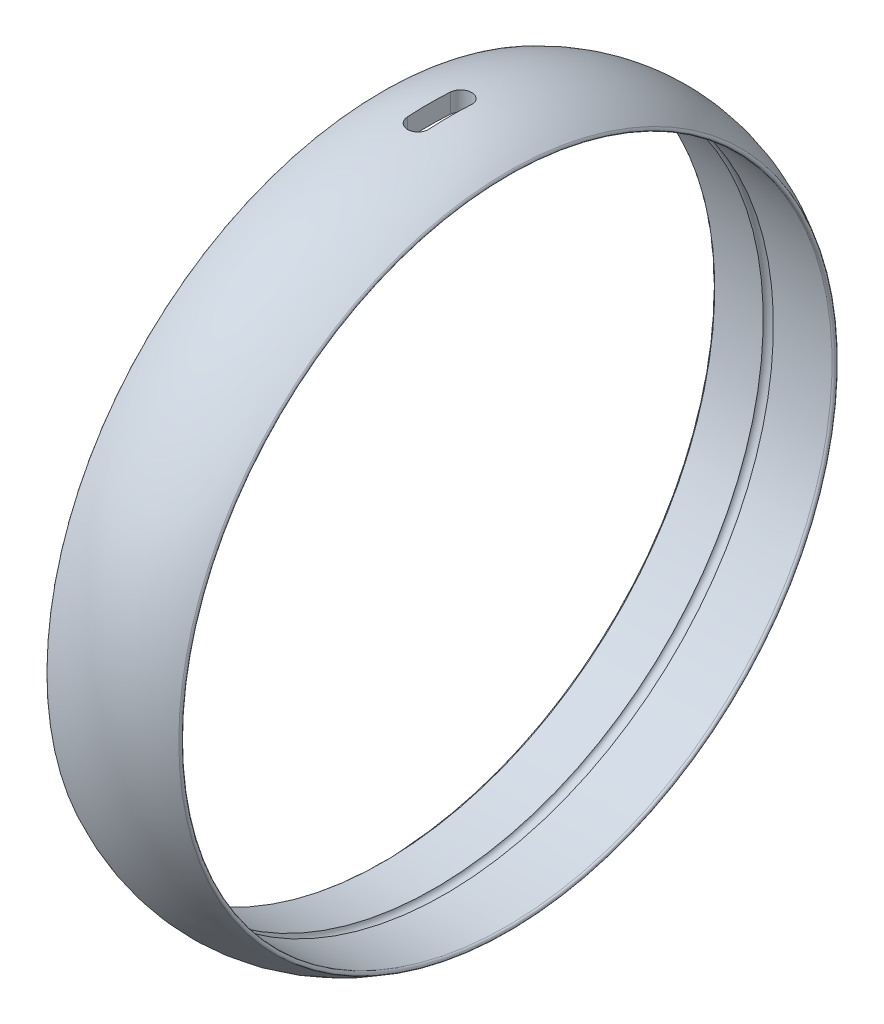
ISO-10303-21;
HEADER;
FILE_DESCRIPTION(('STEP AP214'),'2;1');
FILE_NAME('part.step','',(''),(''),'','','');
FILE_SCHEMA(('AUTOMOTIVE_DESIGN { 1 0 10303 214 1 1 1 1 }'));
ENDSEC;
DATA;
#1=APPLICATION_CONTEXT('core data for automotive mechanical design processes');
#2=APPLICATION_PROTOCOL_DEFINITION('international standard','automotive_design',2000,#1);
#3=PRODUCT_CONTEXT('',#1,'mechanical');
#4=PRODUCT('Part','Part','',(#3));
#5=PRODUCT_RELATED_PRODUCT_CATEGORY('part','',(#4));
#6=PRODUCT_DEFINITION_FORMATION('','',#4);
#7=PRODUCT_DEFINITION_CONTEXT('part definition',#1,'design');
#8=PRODUCT_DEFINITION('design','',#6,#7);
#9=PRODUCT_DEFINITION_SHAPE('','',#8);
#10=(LENGTH_UNIT() NAMED_UNIT(*) SI_UNIT(.MILLI.,.METRE.));
#11=(NAMED_UNIT(*) PLANE_ANGLE_UNIT() SI_UNIT($,.RADIAN.));
#12=(NAMED_UNIT(*) SI_UNIT($,.STERADIAN.) SOLID_ANGLE_UNIT());
#13=UNCERTAINTY_MEASURE_WITH_UNIT(LENGTH_MEASURE(1.E-05),#10,'distance_accuracy_value','');
#14=(GEOMETRIC_REPRESENTATION_CONTEXT(3) GLOBAL_UNCERTAINTY_ASSIGNED_CONTEXT((#13)) GLOBAL_UNIT_ASSIGNED_CONTEXT((#10,
#11,#12)) REPRESENTATION_CONTEXT('',''));
#15=CARTESIAN_POINT('',(0.,0.,0.));
#16=DIRECTION('',(0.,0.,1.));
#17=DIRECTION('',(1.,0.,0.));
#18=AXIS2_PLACEMENT_3D('',#15,#16,#17);
#19=CARTESIAN_POINT('',(152.4,0.,0.));
#20=DIRECTION('',(-1.,0.,0.));
#21=DIRECTION('',(0.,0.,1.));
#22=AXIS2_PLACEMENT_3D('',#19,#20,#21);
#23=CONICAL_SURFACE('',#22,98.625183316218,0.0493739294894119);
#24=CARTESIAN_POINT('',(154.705591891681,0.,0.));
#25=DIRECTION('',(-1.,0.,0.));
#26=DIRECTION('',(0.,0.,1.));
#27=AXIS2_PLACEMENT_3D('',#24,#25,#26);
#28=CIRCLE('',#27,98.5112545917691);
#29=CARTESIAN_POINT('',(154.705591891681,0.,98.5112545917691));
#30=VERTEX_POINT('',#29);
#31=EDGE_CURVE('E260',#30,#30,#28,.T.);
#32=ORIENTED_EDGE('',*,*,#31,.T.);
#33=EDGE_LOOP('',(#32));
#34=FACE_BOUND('',#33,.T.);
#35=CARTESIAN_POINT('',(168.275000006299,97.6344682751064,-6.3498));
#36=CARTESIAN_POINT('',(168.274985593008,97.6286413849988,-6.43942378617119));
#37=CARTESIAN_POINT('',(168.278783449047,97.6225010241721,-6.52902255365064));
#38=CARTESIAN_POINT('',(168.2939257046,97.6096476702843,-6.70753177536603));
#39=CARTESIAN_POINT('',(168.30526949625,97.602934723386,-6.79644228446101));
#40=CARTESIAN_POINT('',(168.335395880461,97.5890033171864,-6.97277710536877));
#41=CARTESIAN_POINT('',(168.354163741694,97.5817858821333,-7.06020400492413));
#42=CARTESIAN_POINT('',(168.398979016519,97.5669014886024,-7.23310891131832));
#43=CARTESIAN_POINT('',(168.425026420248,97.5592345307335,-7.31858692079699));
#44=CARTESIAN_POINT('',(168.513863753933,97.5356540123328,-7.57129573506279));
#45=CARTESIAN_POINT('',(168.587356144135,97.5191574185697,-7.73484397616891));
#46=CARTESIAN_POINT('',(168.760767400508,97.4852794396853,-8.04722802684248));
#47=CARTESIAN_POINT('',(168.860695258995,97.4678977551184,-8.19605880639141));
#48=CARTESIAN_POINT('',(169.034671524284,97.4406970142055,-8.41319953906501));
#49=CARTESIAN_POINT('',(169.100696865,97.4309234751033,-8.48807292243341));
#50=CARTESIAN_POINT('',(169.239528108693,97.4114514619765,-8.63131071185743));
#51=CARTESIAN_POINT('',(169.312334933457,97.4017529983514,-8.69967423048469));
#52=CARTESIAN_POINT('',(169.464275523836,97.3825386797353,-8.8294207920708));
#53=CARTESIAN_POINT('',(169.543425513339,97.3730233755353,-8.8907848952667));
#54=CARTESIAN_POINT('',(169.70718156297,97.35432724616,-9.00579391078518));
#55=CARTESIAN_POINT('',(169.79178749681,97.3451464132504,-9.05943900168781));
#56=CARTESIAN_POINT('',(169.878771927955,97.3361952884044,-9.1089612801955));
#57=B_SPLINE_CURVE_WITH_KNOTS('',3,(#35,#36,#37,#38,#39,#40,#41,#42,#43,#44,#45,#46,#47,#48,#49,
#50,#51,#52,#53,#54,#55,#56),.UNSPECIFIED.,.F.,.F.,(4,2,2,2,2,2,2,2,2,2,4),(0.,
0.269349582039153,0.538677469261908,0.807473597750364,1.07626936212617,1.6137323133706,
2.15137832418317,2.45190660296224,2.75247579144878,3.05383990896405,3.35519705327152),.UNSPECIFIED.);
#58=CARTESIAN_POINT('',(168.275,97.634455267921,-6.35));
#59=VERTEX_POINT('',#58);
#60=CARTESIAN_POINT('',(169.878571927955,97.3362158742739,-9.10884737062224));
#61=VERTEX_POINT('',#60);
#62=EDGE_CURVE('E226',#59,#61,#57,.T.);
#63=ORIENTED_EDGE('',*,*,#62,.F.);
#64=CARTESIAN_POINT('',(168.275,0.,0.));
#65=DIRECTION('',(1.,0.,0.));
#66=DIRECTION('',(0.,0.,-1.));
#67=AXIS2_PLACEMENT_3D('',#64,#65,#66);
#68=CIRCLE('',#67,97.8407346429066);
#69=CARTESIAN_POINT('',(168.275,97.634455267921,6.35));
#70=VERTEX_POINT('',#69);
#71=EDGE_CURVE('E240',#70,#59,#68,.F.);
#72=ORIENTED_EDGE('',*,*,#71,.F.);
#73=CARTESIAN_POINT('',(169.878771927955,97.3361952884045,9.10896128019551));
#74=CARTESIAN_POINT('',(169.800751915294,97.3442243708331,9.06453855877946));
#75=CARTESIAN_POINT('',(169.724643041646,97.3524379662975,9.01680264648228));
#76=CARTESIAN_POINT('',(169.576761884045,97.3691438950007,8.91508166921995));
#77=CARTESIAN_POINT('',(169.504989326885,97.3776362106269,8.86109699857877));
#78=CARTESIAN_POINT('',(169.36640151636,97.3947959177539,8.74734555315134));
#79=CARTESIAN_POINT('',(169.299578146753,97.4034629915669,8.68758863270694));
#80=CARTESIAN_POINT('',(169.171238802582,97.4208904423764,8.56266822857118));
#81=CARTESIAN_POINT('',(169.109722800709,97.4296508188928,8.49750477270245));
#82=CARTESIAN_POINT('',(168.933717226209,97.4559450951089,8.29447438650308));
#83=CARTESIAN_POINT('',(168.827750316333,97.4734946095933,8.14905117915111));
#84=CARTESIAN_POINT('',(168.64183998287,97.5078675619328,7.84232398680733));
#85=CARTESIAN_POINT('',(168.561900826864,97.524690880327,7.68101740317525));
#86=CARTESIAN_POINT('',(168.459793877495,97.5497073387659,7.42198270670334));
#87=CARTESIAN_POINT('',(168.427776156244,97.5583961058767,7.32807322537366));
#88=CARTESIAN_POINT('',(168.372640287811,97.5752485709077,7.13759391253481));
#89=CARTESIAN_POINT('',(168.349523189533,97.583412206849,7.04102376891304));
#90=CARTESIAN_POINT('',(168.312375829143,97.5991409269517,6.84581919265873));
#91=CARTESIAN_POINT('',(168.298371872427,97.6067042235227,6.74717962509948));
#92=CARTESIAN_POINT('',(168.279673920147,97.6211304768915,6.54897052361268));
#93=CARTESIAN_POINT('',(168.274980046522,97.6279934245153,6.44940097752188));
#94=CARTESIAN_POINT('',(168.275000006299,97.6344682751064,6.34979999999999));
#95=B_SPLINE_CURVE_WITH_KNOTS('',3,(#73,#74,#75,#76,#77,#78,#79,#80,#81,#82,#83,#84,#85,#86,#87,
#88,#89,#90,#91,#92,#93,#94),.UNSPECIFIED.,.F.,.F.,(4,2,2,2,2,2,2,2,2,2,4),(0.,
0.270326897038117,0.540636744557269,0.810493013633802,1.08034789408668,1.6199814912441,
2.15970352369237,2.4581182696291,2.75656817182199,3.05587578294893,3.35518731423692),.UNSPECIFIED.);
#96=CARTESIAN_POINT('',(169.878571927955,97.3362158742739,9.10884737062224));
#97=VERTEX_POINT('',#96);
#98=EDGE_CURVE('E119',#97,#70,#95,.T.);
#99=ORIENTED_EDGE('',*,*,#98,.F.);
#100=CARTESIAN_POINT('',(169.878571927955,0.,0.));
#101=DIRECTION('',(-1.,0.,0.));
#102=DIRECTION('',(0.,0.,1.));
#103=AXIS2_PLACEMENT_3D('',#100,#101,#102);
#104=CIRCLE('',#103,97.7614955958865);
#105=EDGE_CURVE('E248',#61,#97,#104,.T.);
#106=ORIENTED_EDGE('',*,*,#105,.F.);
#107=EDGE_LOOP('',(#63,#72,#99,#106));
#108=FACE_BOUND('',#107,.T.);
#109=ADVANCED_FACE('F38',(#34,#108),#23,.F.);
#110=CARTESIAN_POINT('',(171.45,0.,0.));
#111=DIRECTION('',(-1.,0.,0.));
#112=DIRECTION('',(0.,0.,1.));
#113=AXIS2_PLACEMENT_3D('',#110,#111,#112);
#114=TOROIDAL_SURFACE('',#113,65.1692128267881,38.4994085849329);
#115=CARTESIAN_POINT('',(154.456647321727,0.,0.));
#116=DIRECTION('',(1.,0.,0.));
#117=DIRECTION('',(0.,0.,-1.));
#118=AXIS2_PLACEMENT_3D('',#115,#116,#117);
#119=CIRCLE('',#118,99.7152752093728);
#120=CARTESIAN_POINT('',(154.456647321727,0.,-99.7152752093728));
#121=VERTEX_POINT('',#120);
#122=EDGE_CURVE('E252',#121,#121,#119,.T.);
#123=ORIENTED_EDGE('',*,*,#122,.T.);
#124=EDGE_LOOP('',(#123));
#125=FACE_BOUND('',#124,.T.);
#126=CARTESIAN_POINT('',(191.766376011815,0.,0.));
#127=DIRECTION('',(-1.,0.,0.));
#128=DIRECTION('',(0.,0.,1.));
#129=AXIS2_PLACEMENT_3D('',#126,#127,#128);
#130=CIRCLE('',#129,97.8716489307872);
#131=CARTESIAN_POINT('',(191.766376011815,0.,97.8716489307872));
#132=VERTEX_POINT('',#131);
#133=EDGE_CURVE('E255',#132,#132,#130,.T.);
#134=ORIENTED_EDGE('',*,*,#133,.T.);
#135=EDGE_LOOP('',(#134));
#136=FACE_BOUND('',#135,.T.);
#137=CARTESIAN_POINT('',(181.858260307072,-102.235,0.));
#138=CARTESIAN_POINT('',(181.858267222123,-102.235,0.820958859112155));
#139=CARTESIAN_POINT('',(181.823145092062,-102.235,1.64200007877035));
#140=CARTESIAN_POINT('',(181.681390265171,-102.235,3.27863716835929));
#141=CARTESIAN_POINT('',(181.574697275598,-102.235,4.09422786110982));
#142=CARTESIAN_POINT('',(181.286236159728,-102.235,5.71051639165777));
#143=CARTESIAN_POINT('',(181.104618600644,-102.235,6.51124075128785));
#144=CARTESIAN_POINT('',(180.659873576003,-102.235,8.08909169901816));
#145=CARTESIAN_POINT('',(180.396857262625,-102.235,8.86624888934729));
#146=CARTESIAN_POINT('',(179.844595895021,-102.235,10.222768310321));
#147=CARTESIAN_POINT('',(179.572707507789,-102.235,10.8091582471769));
#148=CARTESIAN_POINT('',(178.964992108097,-102.235,11.9486574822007));
#149=CARTESIAN_POINT('',(178.629146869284,-102.235,12.5017572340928));
#150=CARTESIAN_POINT('',(177.88170698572,-102.235,13.5639222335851));
#151=CARTESIAN_POINT('',(177.469341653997,-102.235,14.0724541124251));
#152=CARTESIAN_POINT('',(176.563620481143,-102.235,15.011876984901));
#153=CARTESIAN_POINT('',(176.070493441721,-102.235,15.4429803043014));
#154=CARTESIAN_POINT('',(175.200079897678,-102.235,16.0507305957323));
#155=CARTESIAN_POINT('',(174.847392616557,-102.235,16.2625210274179));
#156=CARTESIAN_POINT('',(174.112753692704,-102.235,16.6276473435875));
#157=CARTESIAN_POINT('',(173.730828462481,-102.235,16.7810352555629));
#158=CARTESIAN_POINT('',(172.942035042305,-102.235,17.0184794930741));
#159=CARTESIAN_POINT('',(172.534982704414,-102.235,17.1019364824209));
#160=CARTESIAN_POINT('',(171.712423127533,-102.235,17.1889145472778));
#161=CARTESIAN_POINT('',(171.296921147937,-102.235,17.1924839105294));
#162=CARTESIAN_POINT('',(170.520453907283,-102.235,17.1237059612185));
#163=CARTESIAN_POINT('',(170.158683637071,-102.235,17.0599896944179));
#164=CARTESIAN_POINT('',(169.450305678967,-102.235,16.8749283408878));
#165=CARTESIAN_POINT('',(169.103704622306,-102.235,16.7535583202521));
#166=CARTESIAN_POINT('',(168.333540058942,-102.235,16.4181170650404));
#167=CARTESIAN_POINT('',(167.917305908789,-102.235,16.1872828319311));
#168=CARTESIAN_POINT('',(167.127747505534,-102.235,15.6613608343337));
#169=CARTESIAN_POINT('',(166.75450576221,-102.235,15.3661525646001));
#170=CARTESIAN_POINT('',(165.89106956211,-102.235,14.5821004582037));
#171=CARTESIAN_POINT('',(165.425395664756,-102.235,14.0664248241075));
#172=CARTESIAN_POINT('',(164.579043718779,-102.235,12.969847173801));
#173=CARTESIAN_POINT('',(164.198544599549,-102.235,12.3888116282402));
#174=CARTESIAN_POINT('',(163.582339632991,-102.235,11.3061531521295));
#175=CARTESIAN_POINT('',(163.332910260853,-102.235,10.8121769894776));
#176=CARTESIAN_POINT('',(162.87752946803,-102.235,9.8043663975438));
#177=CARTESIAN_POINT('',(162.671603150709,-102.235,9.29052070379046));
#178=CARTESIAN_POINT('',(162.299389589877,-102.235,8.24777731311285));
#179=CARTESIAN_POINT('',(162.133172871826,-102.235,7.7188546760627));
#180=CARTESIAN_POINT('',(161.837966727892,-102.235,6.65087790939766));
#181=CARTESIAN_POINT('',(161.708974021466,-102.235,6.11182467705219));
#182=CARTESIAN_POINT('',(161.439911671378,-102.235,4.80239330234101));
#183=CARTESIAN_POINT('',(161.317260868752,-102.235,4.02840460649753));
#184=CARTESIAN_POINT('',(161.137744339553,-102.235,2.47265066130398));
#185=CARTESIAN_POINT('',(161.080909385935,-102.235,1.6908819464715));
#186=CARTESIAN_POINT('',(161.03130784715,-102.235,0.125059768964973));
#187=CARTESIAN_POINT('',(161.038563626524,-102.235,-0.658994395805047));
#188=CARTESIAN_POINT('',(161.117411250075,-102.235,-2.22364526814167));
#189=CARTESIAN_POINT('',(161.188977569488,-102.235,-3.0042432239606));
#190=CARTESIAN_POINT('',(161.373528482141,-102.235,-4.37007410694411));
#191=CARTESIAN_POINT('',(161.472449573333,-102.235,-4.95723007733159));
#192=CARTESIAN_POINT('',(161.710674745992,-102.235,-6.12344462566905));
#193=CARTESIAN_POINT('',(161.849982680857,-102.235,-6.70250242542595));
#194=CARTESIAN_POINT('',(162.171320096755,-102.235,-7.84732461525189));
#195=CARTESIAN_POINT('',(162.353251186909,-102.235,-8.41311636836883));
#196=CARTESIAN_POINT('',(162.763561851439,-102.235,-9.52738290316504));
#197=CARTESIAN_POINT('',(162.991915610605,-102.235,-10.0758671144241));
#198=CARTESIAN_POINT('',(163.544599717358,-102.235,-11.2434625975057));
#199=CARTESIAN_POINT('',(163.878748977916,-102.235,-11.8580103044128));
#200=CARTESIAN_POINT('',(164.627398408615,-102.235,-13.0366543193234));
#201=CARTESIAN_POINT('',(165.041818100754,-102.235,-13.6008003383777));
#202=CARTESIAN_POINT('',(165.845892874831,-102.235,-14.5195244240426));
#203=CARTESIAN_POINT('',(166.215820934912,-102.235,-14.8912286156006));
#204=CARTESIAN_POINT('',(167.009074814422,-102.235,-15.5728580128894));
#205=CARTESIAN_POINT('',(167.432309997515,-102.235,-15.8828858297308));
#206=CARTESIAN_POINT('',(168.224331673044,-102.235,-16.3554540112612));
#207=CARTESIAN_POINT('',(168.582585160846,-102.235,-16.5355320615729));
#208=CARTESIAN_POINT('',(169.32390355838,-102.235,-16.8345620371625));
#209=CARTESIAN_POINT('',(169.706946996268,-102.235,-16.95356608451));
#210=CARTESIAN_POINT('',(170.491113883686,-102.235,-17.121194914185));
#211=CARTESIAN_POINT('',(170.892340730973,-102.235,-17.169345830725));
#212=CARTESIAN_POINT('',(171.696652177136,-102.235,-17.1889269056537));
#213=CARTESIAN_POINT('',(172.099736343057,-102.235,-17.1603741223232));
#214=CARTESIAN_POINT('',(172.853699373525,-102.235,-17.0361166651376));
#215=CARTESIAN_POINT('',(173.205770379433,-102.235,-16.9474064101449));
#216=CARTESIAN_POINT('',(173.891901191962,-102.235,-16.7168478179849));
#217=CARTESIAN_POINT('',(174.225953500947,-102.235,-16.574977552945));
#218=CARTESIAN_POINT('',(174.996276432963,-102.235,-16.1825128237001));
#219=CARTESIAN_POINT('',(175.421920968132,-102.235,-15.9110910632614));
#220=CARTESIAN_POINT('',(176.224075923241,-102.235,-15.3036051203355));
#221=CARTESIAN_POINT('',(176.600480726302,-102.235,-14.9674056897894));
#222=CARTESIAN_POINT('',(177.478337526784,-102.235,-14.0711714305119));
#223=CARTESIAN_POINT('',(177.950357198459,-102.235,-13.4823223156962));
#224=CARTESIAN_POINT('',(178.586097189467,-102.235,-12.5511638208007));
#225=CARTESIAN_POINT('',(178.786228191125,-102.235,-12.232239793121));
#226=CARTESIAN_POINT('',(179.164028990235,-102.235,-11.581327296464));
#227=CARTESIAN_POINT('',(179.341703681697,-102.235,-11.2493416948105));
#228=CARTESIAN_POINT('',(179.776078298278,-102.235,-10.3732670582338));
#229=CARTESIAN_POINT('',(180.016473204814,-102.235,-9.82109409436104));
#230=CARTESIAN_POINT('',(180.448849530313,-102.235,-8.69798677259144));
#231=CARTESIAN_POINT('',(180.640799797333,-102.235,-8.12704060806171));
#232=CARTESIAN_POINT('',(180.980026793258,-102.235,-6.97245400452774));
#233=CARTESIAN_POINT('',(181.127327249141,-102.235,-6.38882048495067));
#234=CARTESIAN_POINT('',(181.380288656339,-102.235,-5.21291652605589));
#235=CARTESIAN_POINT('',(181.485964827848,-102.235,-4.62064932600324));
#236=CARTESIAN_POINT('',(181.668051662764,-102.235,-3.359558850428));
#237=CARTESIAN_POINT('',(181.739480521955,-102.235,-2.69001572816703));
#238=CARTESIAN_POINT('',(181.834604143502,-102.235,-1.34700225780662));
#239=CARTESIAN_POINT('',(181.858254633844,-102.235,-0.673528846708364));
#240=CARTESIAN_POINT('',(181.858260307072,-102.235,0.));
#241=B_SPLINE_CURVE_WITH_KNOTS('',3,(#137,#138,#139,#140,#141,#142,#143,#144,#145,#146,#147,
#148,#149,#150,#151,#152,#153,#154,#155,#156,#157,#158,#159,#160,#161,#162,#163,#164,#165,#166,
#167,#168,#169,#170,#171,#172,#173,#174,#175,#176,#177,#178,#179,#180,#181,#182,#183,#184,#185,
#186,#187,#188,#189,#190,#191,#192,#193,#194,#195,#196,#197,#198,#199,#200,#201,#202,#203,#204,
#205,#206,#207,#208,#209,#210,#211,#212,#213,#214,#215,#216,#217,#218,#219,#220,#221,#222,#223,
#224,#225,#226,#227,#228,#229,#230,#231,#232,#233,#234,#235,#236,#237,#238,#239,#240),
.UNSPECIFIED.,.T.,.F.,(4,2,2,2,2,2,2,2,2,2,2,2,2,2,2,2,2,2,2,2,2,2,2,2,2,2,2,2,2,2,2,2,2,2,2,2,
2,2,2,2,2,2,2,2,2,2,2,2,2,2,2,4),(0.,2.46225475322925,4.92658636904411,7.38598964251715,
9.84204924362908,11.777867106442,13.7142374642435,15.6712879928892,17.6228870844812,
18.8527775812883,20.0815698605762,21.3207886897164,22.5592584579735,23.6561645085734,
24.7535453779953,26.1735346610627,27.5962052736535,29.6691428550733,31.7463950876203,
33.4043161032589,35.0631912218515,36.7249910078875,38.3866442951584,40.734411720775,
43.0832764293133,45.432960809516,47.7817130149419,49.5667369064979,51.3519311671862,
53.1330444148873,54.9131698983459,57.0066567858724,59.0980555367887,60.6664104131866,
62.2321337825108,63.430397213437,64.6276363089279,65.8328467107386,67.0377891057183,
68.1223414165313,69.2073415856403,70.7133026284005,72.2224426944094,74.4731036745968,
75.6021071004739,76.7308640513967,78.5348284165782,80.339949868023,82.1441103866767,
83.9476105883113,85.9658177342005,87.9858941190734),.UNSPECIFIED.);
#242=CARTESIAN_POINT('',(161.218892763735,-102.235,3.175));
#243=VERTEX_POINT('',#242);
#244=CARTESIAN_POINT('',(161.218892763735,-102.235,-3.175));
#245=VERTEX_POINT('',#244);
#246=EDGE_CURVE('E199',#243,#245,#241,.T.);
#247=ORIENTED_EDGE('',*,*,#246,.F.);
#248=CARTESIAN_POINT('',(159.520627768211,-101.724246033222,3.175));
#249=CARTESIAN_POINT('',(158.492399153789,-101.388992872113,3.175));
#250=CARTESIAN_POINT('',(157.478433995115,-101.010403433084,3.175));
#251=CARTESIAN_POINT('',(155.485651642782,-100.169067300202,3.175));
#252=CARTESIAN_POINT('',(154.506843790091,-99.7062984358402,3.175));
#253=CARTESIAN_POINT('',(152.590629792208,-98.6994224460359,3.175));
#254=CARTESIAN_POINT('',(151.653270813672,-98.1552255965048,3.175));
#255=CARTESIAN_POINT('',(149.827821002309,-96.9897883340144,3.175));
#256=CARTESIAN_POINT('',(148.939726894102,-96.3685530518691,3.175));
#257=CARTESIAN_POINT('',(147.21946514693,-95.0537497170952,3.175));
#258=CARTESIAN_POINT('',(146.387271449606,-94.3602157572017,3.175));
#259=CARTESIAN_POINT('',(144.784249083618,-92.9055010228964,3.175));
#260=CARTESIAN_POINT('',(144.01342138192,-92.1443191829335,3.175));
#261=CARTESIAN_POINT('',(142.538804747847,-90.5599397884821,3.175));
#262=CARTESIAN_POINT('',(141.834998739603,-89.7367581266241,3.175));
#263=CARTESIAN_POINT('',(140.499192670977,-88.0340667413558,3.175));
#264=CARTESIAN_POINT('',(139.867192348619,-87.1545572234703,3.175));
#265=CARTESIAN_POINT('',(138.679216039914,-85.3450759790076,3.175));
#266=CARTESIAN_POINT('',(138.123272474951,-84.4150829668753,3.175));
#267=CARTESIAN_POINT('',(137.091659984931,-82.5115908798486,3.175));
#268=CARTESIAN_POINT('',(136.615991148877,-81.5380917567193,3.175));
#269=CARTESIAN_POINT('',(135.748270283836,-79.5544687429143,3.175));
#270=CARTESIAN_POINT('',(135.356221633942,-78.5443433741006,3.175));
#271=CARTESIAN_POINT('',(134.658526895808,-76.4946821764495,3.175));
#272=CARTESIAN_POINT('',(134.352880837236,-75.4551463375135,3.175));
#273=CARTESIAN_POINT('',(133.829948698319,-73.3532932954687,3.175));
#274=CARTESIAN_POINT('',(133.612725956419,-72.2909603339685,3.175));
#275=CARTESIAN_POINT('',(133.268469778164,-70.1517809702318,3.175));
#276=CARTESIAN_POINT('',(133.14143637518,-69.0749345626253,3.175));
#277=CARTESIAN_POINT('',(132.978430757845,-66.9143709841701,3.175));
#278=CARTESIAN_POINT('',(132.942458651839,-65.830653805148,3.175));
#279=CARTESIAN_POINT('',(132.96179919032,-63.664034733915,3.175));
#280=CARTESIAN_POINT('',(133.017111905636,-62.5811328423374,3.175));
#281=CARTESIAN_POINT('',(133.218709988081,-60.4226057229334,3.175));
#282=CARTESIAN_POINT('',(133.365097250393,-59.3469900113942,3.175));
#283=CARTESIAN_POINT('',(133.747862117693,-57.2118920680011,3.175));
#284=CARTESIAN_POINT('',(133.984239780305,-56.1524098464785,3.175));
#285=CARTESIAN_POINT('',(134.545276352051,-54.0570798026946,3.175));
#286=CARTESIAN_POINT('',(134.86993559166,-53.0212320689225,3.175));
#287=CARTESIAN_POINT('',(135.605202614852,-50.9805038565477,3.175));
#288=CARTESIAN_POINT('',(136.015810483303,-49.9756234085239,3.175));
#289=CARTESIAN_POINT('',(136.920695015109,-48.00250520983,3.175));
#290=CARTESIAN_POINT('',(137.415091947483,-47.0343226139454,3.175));
#291=CARTESIAN_POINT('',(138.483610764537,-45.1429984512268,3.175));
#292=CARTESIAN_POINT('',(139.057732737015,-44.2198569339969,3.175));
#293=CARTESIAN_POINT('',(140.281626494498,-42.4251432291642,3.175));
#294=CARTESIAN_POINT('',(140.931399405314,-41.5535718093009,3.175));
#295=CARTESIAN_POINT('',(142.301980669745,-39.8681955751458,3.175));
#296=CARTESIAN_POINT('',(143.022789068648,-39.0543907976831,3.175));
#297=CARTESIAN_POINT('',(144.531155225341,-37.4894940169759,3.175));
#298=CARTESIAN_POINT('',(145.318783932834,-36.7384703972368,3.175));
#299=CARTESIAN_POINT('',(146.95455106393,-35.3054915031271,3.175));
#300=CARTESIAN_POINT('',(147.802689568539,-34.6235363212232,3.175));
#301=CARTESIAN_POINT('',(149.553487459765,-33.3336100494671,3.175));
#302=CARTESIAN_POINT('',(150.456147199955,-32.7256394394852,3.175));
#303=CARTESIAN_POINT('',(152.309599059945,-31.5881203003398,3.175));
#304=CARTESIAN_POINT('',(153.260391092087,-31.0585716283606,3.175));
#305=CARTESIAN_POINT('',(155.201870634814,-30.082563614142,3.175));
#306=CARTESIAN_POINT('',(156.192494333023,-29.6359773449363,3.175));
#307=CARTESIAN_POINT('',(158.207983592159,-28.8282328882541,3.175));
#308=CARTESIAN_POINT('',(159.232849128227,-28.46707463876,3.175));
#309=CARTESIAN_POINT('',(161.309462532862,-27.832959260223,3.175));
#310=CARTESIAN_POINT('',(162.36120909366,-27.5599978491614,3.175));
#311=CARTESIAN_POINT('',(164.484083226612,-27.1043763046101,3.175));
#312=CARTESIAN_POINT('',(165.555210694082,-26.921715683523,3.175));
#313=CARTESIAN_POINT('',(167.702658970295,-26.6489570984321,3.175));
#314=CARTESIAN_POINT('',(168.778910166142,-26.5583108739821,3.175));
#315=CARTESIAN_POINT('',(170.935221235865,-26.4683782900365,3.175));
#316=CARTESIAN_POINT('',(172.015281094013,-26.4690915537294,3.175));
#317=CARTESIAN_POINT('',(174.17145095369,-26.5618710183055,3.175));
#318=CARTESIAN_POINT('',(175.247561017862,-26.6539357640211,3.175));
#319=CARTESIAN_POINT('',(177.388146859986,-26.9286897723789,3.175));
#320=CARTESIAN_POINT('',(178.452622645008,-27.1113789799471,3.175));
#321=CARTESIAN_POINT('',(180.558452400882,-27.5651151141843,3.175));
#322=CARTESIAN_POINT('',(181.599877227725,-27.8358333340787,3.175));
#323=CARTESIAN_POINT('',(183.656315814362,-28.4637439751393,3.175));
#324=CARTESIAN_POINT('',(184.671329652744,-28.8209361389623,3.175));
#325=CARTESIAN_POINT('',(186.667877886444,-29.6191314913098,3.175));
#326=CARTESIAN_POINT('',(187.649411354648,-30.0601369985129,3.175));
#327=CARTESIAN_POINT('',(189.572145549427,-31.0227119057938,3.175));
#328=CARTESIAN_POINT('',(190.513346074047,-31.5442817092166,3.175));
#329=CARTESIAN_POINT('',(192.353451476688,-32.6669980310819,3.175));
#330=CARTESIAN_POINT('',(193.252123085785,-33.2685268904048,3.175));
#331=CARTESIAN_POINT('',(194.995867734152,-34.5448119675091,3.175));
#332=CARTESIAN_POINT('',(195.840940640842,-35.2195683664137,3.175));
#333=CARTESIAN_POINT('',(197.471603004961,-36.6375117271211,3.175));
#334=CARTESIAN_POINT('',(198.257191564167,-37.3806997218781,3.175));
#335=CARTESIAN_POINT('',(199.763385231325,-38.9302419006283,3.175));
#336=CARTESIAN_POINT('',(200.48399015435,-39.7365962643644,3.175));
#337=CARTESIAN_POINT('',(201.858825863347,-41.4112455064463,3.175));
#338=CARTESIAN_POINT('',(202.512682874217,-42.2798472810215,3.175));
#339=CARTESIAN_POINT('',(203.744985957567,-44.068994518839,3.175));
#340=CARTESIAN_POINT('',(204.323431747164,-44.989540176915,3.175));
#341=CARTESIAN_POINT('',(205.400800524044,-46.8760573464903,3.175));
#342=CARTESIAN_POINT('',(205.899722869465,-47.8420292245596,3.175));
#343=CARTESIAN_POINT('',(206.814476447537,-49.8125453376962,3.175));
#344=CARTESIAN_POINT('',(207.230307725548,-50.817089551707,3.175));
#345=CARTESIAN_POINT('',(207.976235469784,-52.858550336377,3.175));
#346=CARTESIAN_POINT('',(208.30625422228,-53.8954953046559,3.175));
#347=CARTESIAN_POINT('',(208.877682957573,-55.9935211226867,3.175));
#348=CARTESIAN_POINT('',(209.119092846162,-57.0546019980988,3.175));
#349=CARTESIAN_POINT('',(209.511548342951,-59.1933421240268,3.175));
#350=CARTESIAN_POINT('',(209.662594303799,-60.2710013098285,3.175));
#351=CARTESIAN_POINT('',(209.873211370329,-62.4352217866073,3.175));
#352=CARTESIAN_POINT('',(209.93278258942,-63.5217830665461,3.175));
#353=CARTESIAN_POINT('',(209.95997494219,-65.694720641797,3.175));
#354=CARTESIAN_POINT('',(209.927708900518,-66.7810955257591,3.175));
#355=CARTESIAN_POINT('',(209.77166707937,-68.9472538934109,3.175));
#356=CARTESIAN_POINT('',(209.647891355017,-70.0270373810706,3.175));
#357=CARTESIAN_POINT('',(209.309683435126,-72.1723087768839,3.175));
#358=CARTESIAN_POINT('',(209.095251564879,-73.2377967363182,3.175));
#359=CARTESIAN_POINT('',(208.577233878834,-75.3468754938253,3.175));
#360=CARTESIAN_POINT('',(208.273648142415,-76.3904663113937,3.175));
#361=CARTESIAN_POINT('',(207.579956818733,-78.4468399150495,3.175));
#362=CARTESIAN_POINT('',(207.189974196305,-79.4596641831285,3.175));
#363=CARTESIAN_POINT('',(206.325999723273,-81.4488241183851,3.175));
#364=CARTESIAN_POINT('',(205.852007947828,-82.4251598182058,3.175));
#365=CARTESIAN_POINT('',(204.823374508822,-84.3343768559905,3.175));
#366=CARTESIAN_POINT('',(204.268733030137,-85.2672582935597,3.175));
#367=CARTESIAN_POINT('',(203.082736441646,-87.0829115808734,3.175));
#368=CARTESIAN_POINT('',(202.451381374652,-87.9656834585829,3.175));
#369=CARTESIAN_POINT('',(201.117136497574,-89.6739305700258,3.175));
#370=CARTESIAN_POINT('',(200.414321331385,-90.4994641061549,3.175));
#371=CARTESIAN_POINT('',(198.941605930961,-92.0883512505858,3.175));
#372=CARTESIAN_POINT('',(198.171705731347,-92.8517048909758,3.175));
#373=CARTESIAN_POINT('',(196.570325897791,-94.3107587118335,3.175));
#374=CARTESIAN_POINT('',(195.738848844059,-95.0064617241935,3.175));
#375=CARTESIAN_POINT('',(194.020201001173,-96.325288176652,3.175));
#376=CARTESIAN_POINT('',(193.133030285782,-96.9484117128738,3.175));
#377=CARTESIAN_POINT('',(191.310022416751,-98.1171764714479,3.175));
#378=CARTESIAN_POINT('',(190.374223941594,-98.6628780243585,3.175));
#379=CARTESIAN_POINT('',(188.459970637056,-99.6734923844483,3.175));
#380=CARTESIAN_POINT('',(187.481515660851,-100.138404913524,3.175));
#381=CARTESIAN_POINT('',(185.488656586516,-100.984233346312,3.175));
#382=CARTESIAN_POINT('',(184.474243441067,-101.365127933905,3.175));
#383=CARTESIAN_POINT('',(182.416937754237,-102.040049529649,3.175));
#384=CARTESIAN_POINT('',(181.374045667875,-102.334077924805,3.175));
#385=CARTESIAN_POINT('',(179.26711224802,-102.833196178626,3.175));
#386=CARTESIAN_POINT('',(178.203069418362,-103.038279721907,3.175));
#387=CARTESIAN_POINT('',(176.061415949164,-103.358027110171,3.175));
#388=CARTESIAN_POINT('',(174.983804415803,-103.472684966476,3.175));
#389=CARTESIAN_POINT('',(172.823932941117,-103.61065916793,3.175));
#390=CARTESIAN_POINT('',(171.741679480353,-103.634076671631,3.175));
#391=CARTESIAN_POINT('',(169.579396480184,-103.589706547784,3.175));
#392=CARTESIAN_POINT('',(168.499366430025,-103.521942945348,3.175));
#393=CARTESIAN_POINT('',(166.082217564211,-103.267642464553,3.175));
#394=CARTESIAN_POINT('',(164.747685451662,-103.055842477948,3.175));
#395=CARTESIAN_POINT('',(162.10824567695,-102.493257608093,3.175));
#396=CARTESIAN_POINT('',(160.803338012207,-102.142472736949,3.175));
#397=CARTESIAN_POINT('',(159.520627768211,-101.724246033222,3.175));
#398=B_SPLINE_CURVE_WITH_KNOTS('',3,(#248,#249,#250,#251,#252,#253,#254,#255,#256,#257,#258,
#259,#260,#261,#262,#263,#264,#265,#266,#267,#268,#269,#270,#271,#272,#273,#274,#275,#276,#277,
#278,#279,#280,#281,#282,#283,#284,#285,#286,#287,#288,#289,#290,#291,#292,#293,#294,#295,#296,
#297,#298,#299,#300,#301,#302,#303,#304,#305,#306,#307,#308,#309,#310,#311,#312,#313,#314,#315,
#316,#317,#318,#319,#320,#321,#322,#323,#324,#325,#326,#327,#328,#329,#330,#331,#332,#333,#334,
#335,#336,#337,#338,#339,#340,#341,#342,#343,#344,#345,#346,#347,#348,#349,#350,#351,#352,#353,
#354,#355,#356,#357,#358,#359,#360,#361,#362,#363,#364,#365,#366,#367,#368,#369,#370,#371,#372,
#373,#374,#375,#376,#377,#378,#379,#380,#381,#382,#383,#384,#385,#386,#387,#388,#389,#390,#391,
#392,#393,#394,#395,#396,#397),.UNSPECIFIED.,.T.,.F.,(4,2,2,2,2,2,2,2,2,2,2,2,2,2,2,2,2,2,2,2,2,
2,2,2,2,2,2,2,2,2,2,2,2,2,2,2,2,2,2,2,2,2,2,2,2,2,2,2,2,2,2,2,2,2,2,2,2,2,2,2,2,2,2,2,2,2,2,2,2,
2,2,2,2,2,4),(0.,3.2433298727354,6.48751518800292,9.73530190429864,12.9828724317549,
16.2289184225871,19.4750155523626,22.7202834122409,25.9655394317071,29.212174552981,
32.4588132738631,35.7055831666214,38.9523541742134,42.2014467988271,45.4505406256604,
48.6996383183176,51.9487385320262,55.2014804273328,58.4542244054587,61.7069805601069,
64.9597399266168,68.2172084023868,71.4746804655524,74.7322010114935,77.9897236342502,
81.2507494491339,84.5117796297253,87.7728309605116,91.0338763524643,94.2898907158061,
97.5459027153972,100.801756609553,104.057592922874,107.293913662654,110.530221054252,
113.766476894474,117.002730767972,120.227036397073,123.451332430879,126.67571767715,
129.900119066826,133.140533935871,136.380956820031,139.621428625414,142.861909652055,
146.119641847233,149.377386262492,152.63515697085,155.892925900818,159.153634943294,
162.414347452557,165.675047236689,168.935742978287,172.192434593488,175.44912424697,
178.705802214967,181.962477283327,185.214546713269,188.466613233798,191.718672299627,
194.970729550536,198.219424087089,201.468116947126,204.716673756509,207.965226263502,
211.211233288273,214.457251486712,217.704092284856,220.950881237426,224.197900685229,
227.445135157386,230.688768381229,233.931547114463,237.977585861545,242.023624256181),.UNSPECIFIED.);
#399=CARTESIAN_POINT('',(181.681107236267,-102.235,3.175));
#400=VERTEX_POINT('',#399);
#401=EDGE_CURVE('E188',#400,#243,#398,.T.);
#402=ORIENTED_EDGE('',*,*,#401,.F.);
#403=CARTESIAN_POINT('',(181.681107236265,-102.235,-3.17500000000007));
#404=VERTEX_POINT('',#403);
#405=EDGE_CURVE('E178',#404,#400,#241,.T.);
#406=ORIENTED_EDGE('',*,*,#405,.F.);
#407=CARTESIAN_POINT('',(159.520627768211,-101.724246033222,-3.175));
#408=CARTESIAN_POINT('',(160.548537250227,-102.059411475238,-3.175));
#409=CARTESIAN_POINT('',(161.590459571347,-102.351188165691,-3.175));
#410=CARTESIAN_POINT('',(163.695508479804,-102.84608720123,-3.175));
#411=CARTESIAN_POINT('',(164.758640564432,-103.049186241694,-3.175));
#412=CARTESIAN_POINT('',(166.899397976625,-103.365312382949,-3.175));
#413=CARTESIAN_POINT('',(167.977038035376,-103.478239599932,-3.175));
#414=CARTESIAN_POINT('',(170.13793472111,-103.612847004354,-3.175));
#415=CARTESIAN_POINT('',(171.221190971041,-103.634533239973,-3.175));
#416=CARTESIAN_POINT('',(173.385185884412,-103.586529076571,-3.175));
#417=CARTESIAN_POINT('',(174.465925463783,-103.516879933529,-3.175));
#418=CARTESIAN_POINT('',(176.61771118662,-103.286771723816,-3.175));
#419=CARTESIAN_POINT('',(177.688757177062,-103.126311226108,-3.175));
#420=CARTESIAN_POINT('',(179.813250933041,-102.71577451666,-3.175));
#421=CARTESIAN_POINT('',(180.8667031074,-102.465721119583,-3.175));
#422=CARTESIAN_POINT('',(182.948798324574,-101.877773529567,-3.175));
#423=CARTESIAN_POINT('',(183.977441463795,-101.539879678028,-3.175));
#424=CARTESIAN_POINT('',(186.002731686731,-100.778611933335,-3.175));
#425=CARTESIAN_POINT('',(186.999375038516,-100.355228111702,-3.175));
#426=CARTESIAN_POINT('',(188.953459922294,-99.4260188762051,-3.175));
#427=CARTESIAN_POINT('',(189.910901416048,-98.9201933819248,-3.175));
#428=CARTESIAN_POINT('',(191.779817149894,-97.8296807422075,-3.175));
#429=CARTESIAN_POINT('',(192.691289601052,-97.244990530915,-3.175));
#430=CARTESIAN_POINT('',(194.461754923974,-96.0009254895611,-3.175));
#431=CARTESIAN_POINT('',(195.320747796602,-95.3415506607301,-3.175));
#432=CARTESIAN_POINT('',(196.980320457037,-93.9526722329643,-3.175));
#433=CARTESIAN_POINT('',(197.780888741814,-93.223154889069,-3.175));
#434=CARTESIAN_POINT('',(199.317745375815,-91.699292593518,-3.175));
#435=CARTESIAN_POINT('',(200.054033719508,-90.9049476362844,-3.175));
#436=CARTESIAN_POINT('',(201.457108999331,-89.2570828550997,-3.175));
#437=CARTESIAN_POINT('',(202.123896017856,-88.4035631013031,-3.175));
#438=CARTESIAN_POINT('',(203.383246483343,-86.6434183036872,-3.175));
#439=CARTESIAN_POINT('',(203.975809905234,-85.7367932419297,-3.175));
#440=CARTESIAN_POINT('',(205.082777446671,-83.8764517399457,-3.175));
#441=CARTESIAN_POINT('',(205.597145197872,-82.9227136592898,-3.175));
#442=CARTESIAN_POINT('',(206.543755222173,-80.9753176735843,-3.175));
#443=CARTESIAN_POINT('',(206.975997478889,-79.9816597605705,-3.175));
#444=CARTESIAN_POINT('',(207.755307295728,-77.9614873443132,-3.175));
#445=CARTESIAN_POINT('',(208.102374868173,-76.9349728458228,-3.175));
#446=CARTESIAN_POINT('',(208.70889512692,-74.8563787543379,-3.175));
#447=CARTESIAN_POINT('',(208.968347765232,-73.8042991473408,-3.175));
#448=CARTESIAN_POINT('',(209.397990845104,-71.6812138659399,-3.175));
#449=CARTESIAN_POINT('',(209.568111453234,-70.6101940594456,-3.175));
#450=CARTESIAN_POINT('',(209.817603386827,-68.4576368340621,-3.175));
#451=CARTESIAN_POINT('',(209.896974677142,-67.3760994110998,-3.175));
#452=CARTESIAN_POINT('',(209.964435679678,-65.2101772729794,-3.175));
#453=CARTESIAN_POINT('',(209.952524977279,-64.1257925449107,-3.175));
#454=CARTESIAN_POINT('',(209.837538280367,-61.9618678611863,-3.175));
#455=CARTESIAN_POINT('',(209.73446221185,-60.882327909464,-3.175));
#456=CARTESIAN_POINT('',(209.437734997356,-58.7344795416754,-3.175));
#457=CARTESIAN_POINT('',(209.243977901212,-57.6661857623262,-3.175));
#458=CARTESIAN_POINT('',(208.767259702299,-55.5496910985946,-3.175));
#459=CARTESIAN_POINT('',(208.484298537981,-54.5014902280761,-3.175));
#460=CARTESIAN_POINT('',(207.831209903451,-52.4325987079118,-3.175));
#461=CARTESIAN_POINT('',(207.461081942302,-51.4119082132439,-3.175));
#462=CARTESIAN_POINT('',(206.636313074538,-49.4052638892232,-3.175));
#463=CARTESIAN_POINT('',(206.181672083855,-48.4193100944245,-3.175));
#464=CARTESIAN_POINT('',(205.19039573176,-46.4876966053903,-3.175));
#465=CARTESIAN_POINT('',(204.653641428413,-45.542097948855,-3.175));
#466=CARTESIAN_POINT('',(203.50245115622,-43.6994310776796,-3.175));
#467=CARTESIAN_POINT('',(202.888015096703,-42.8023629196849,-3.175));
#468=CARTESIAN_POINT('',(201.585816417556,-41.0631055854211,-3.175));
#469=CARTESIAN_POINT('',(200.898052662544,-40.2209172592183,-3.175));
#470=CARTESIAN_POINT('',(199.45407798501,-38.5974178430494,-3.175));
#471=CARTESIAN_POINT('',(198.697867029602,-37.8161067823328,-3.175));
#472=CARTESIAN_POINT('',(197.121631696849,-36.3192584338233,-3.175));
#473=CARTESIAN_POINT('',(196.301550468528,-35.6037810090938,-3.175));
#474=CARTESIAN_POINT('',(194.603967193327,-34.2445345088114,-3.175));
#475=CARTESIAN_POINT('',(193.726465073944,-33.6007655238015,-3.175));
#476=CARTESIAN_POINT('',(191.920242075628,-32.3896038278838,-3.175));
#477=CARTESIAN_POINT('',(190.991521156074,-31.8222111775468,-3.175));
#478=CARTESIAN_POINT('',(189.089435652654,-30.7679686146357,-3.175));
#479=CARTESIAN_POINT('',(188.116071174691,-30.2811185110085,-3.175));
#480=CARTESIAN_POINT('',(186.133709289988,-29.3925310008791,-3.175));
#481=CARTESIAN_POINT('',(185.124791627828,-28.9906157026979,-3.175));
#482=CARTESIAN_POINT('',(183.076549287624,-28.2736380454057,-3.175));
#483=CARTESIAN_POINT('',(182.037224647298,-27.9585755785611,-3.175));
#484=CARTESIAN_POINT('',(179.935650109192,-27.4177442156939,-3.175));
#485=CARTESIAN_POINT('',(178.873401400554,-27.1919706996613,-3.175));
#486=CARTESIAN_POINT('',(176.733566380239,-26.831464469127,-3.175));
#487=CARTESIAN_POINT('',(175.65598015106,-26.6967312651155,-3.175));
#488=CARTESIAN_POINT('',(173.500084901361,-26.5199335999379,-3.175));
#489=CARTESIAN_POINT('',(172.421823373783,-26.4772895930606,-3.175));
#490=CARTESIAN_POINT('',(170.265556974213,-26.4832867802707,-3.175));
#491=CARTESIAN_POINT('',(169.18755210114,-26.5319275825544,-3.175));
#492=CARTESIAN_POINT('',(167.039515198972,-26.7201091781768,-3.175));
#493=CARTESIAN_POINT('',(165.969483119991,-26.8596494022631,-3.175));
#494=CARTESIAN_POINT('',(163.845014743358,-27.2285358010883,-3.175));
#495=CARTESIAN_POINT('',(162.790578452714,-27.4578820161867,-3.175));
#496=CARTESIAN_POINT('',(160.707492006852,-28.0038971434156,-3.175));
#497=CARTESIAN_POINT('',(159.678782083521,-28.3203381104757,-3.175));
#498=CARTESIAN_POINT('',(157.651541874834,-29.0384033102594,-3.175));
#499=CARTESIAN_POINT('',(156.653011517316,-29.4400273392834,-3.175));
#500=CARTESIAN_POINT('',(154.693066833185,-30.3254920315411,-3.175));
#501=CARTESIAN_POINT('',(153.731653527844,-30.8093349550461,-3.175));
#502=CARTESIAN_POINT('',(151.852643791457,-31.8557048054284,-3.175));
#503=CARTESIAN_POINT('',(150.935047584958,-32.4182321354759,-3.175));
#504=CARTESIAN_POINT('',(149.144988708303,-33.6213197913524,-3.175));
#505=CARTESIAN_POINT('',(148.27280980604,-34.2623023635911,-3.175));
#506=CARTESIAN_POINT('',(146.585288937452,-35.6151633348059,-3.175));
#507=CARTESIAN_POINT('',(145.769947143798,-36.3270419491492,-3.175));
#508=CARTESIAN_POINT('',(144.201792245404,-37.8166449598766,-3.175));
#509=CARTESIAN_POINT('',(143.448979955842,-38.5943702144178,-3.175));
#510=CARTESIAN_POINT('',(142.01116741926,-40.2101636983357,-3.175));
#511=CARTESIAN_POINT('',(141.326167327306,-41.0482320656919,-3.175));
#512=CARTESIAN_POINT('',(140.025689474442,-42.782945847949,-3.175));
#513=CARTESIAN_POINT('',(139.410559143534,-43.6798517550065,-3.175));
#514=CARTESIAN_POINT('',(138.257986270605,-45.522266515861,-3.175));
#515=CARTESIAN_POINT('',(137.720543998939,-46.4677755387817,-3.175));
#516=CARTESIAN_POINT('',(136.727177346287,-48.4006983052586,-3.175));
#517=CARTESIAN_POINT('',(136.271253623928,-49.3881123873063,-3.175));
#518=CARTESIAN_POINT('',(135.44419408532,-51.3978330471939,-3.175));
#519=CARTESIAN_POINT('',(135.073058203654,-52.4201395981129,-3.175));
#520=CARTESIAN_POINT('',(134.418094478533,-54.4928583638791,-3.175));
#521=CARTESIAN_POINT('',(134.1343061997,-55.5432830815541,-3.175));
#522=CARTESIAN_POINT('',(133.656319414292,-57.6643237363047,-3.175));
#523=CARTESIAN_POINT('',(133.462120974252,-58.7349396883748,-3.175));
#524=CARTESIAN_POINT('',(133.164733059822,-60.8887368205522,-3.175));
#525=CARTESIAN_POINT('',(133.061543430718,-61.9719179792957,-3.175));
#526=CARTESIAN_POINT('',(132.946943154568,-64.1431245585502,-3.175));
#527=CARTESIAN_POINT('',(132.935532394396,-65.2311499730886,-3.175));
#528=CARTESIAN_POINT('',(133.004558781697,-67.4028611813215,-3.175));
#529=CARTESIAN_POINT('',(133.084876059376,-68.4865507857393,-3.175));
#530=CARTESIAN_POINT('',(133.336622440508,-70.6432956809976,-3.175));
#531=CARTESIAN_POINT('',(133.508051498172,-71.7163509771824,-3.175));
#532=CARTESIAN_POINT('',(133.9408181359,-73.8441266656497,-3.175));
#533=CARTESIAN_POINT('',(134.202151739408,-74.898847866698,-3.175));
#534=CARTESIAN_POINT('',(134.812890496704,-76.9824744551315,-3.175));
#535=CARTESIAN_POINT('',(135.162295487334,-78.0113798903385,-3.175));
#536=CARTESIAN_POINT('',(135.946123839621,-80.0345236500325,-3.175));
#537=CARTESIAN_POINT('',(136.380420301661,-81.0288111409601,-3.175));
#538=CARTESIAN_POINT('',(137.331289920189,-82.9772382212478,-3.175));
#539=CARTESIAN_POINT('',(137.84786332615,-83.9313776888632,-3.175));
#540=CARTESIAN_POINT('',(138.959763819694,-85.7929351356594,-3.175));
#541=CARTESIAN_POINT('',(139.555110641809,-86.7003413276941,-3.175));
#542=CARTESIAN_POINT('',(140.820218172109,-88.4616835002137,-3.175));
#543=CARTESIAN_POINT('',(141.489977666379,-89.3156203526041,-3.175));
#544=CARTESIAN_POINT('',(142.898770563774,-90.9634915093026,-3.175));
#545=CARTESIAN_POINT('',(143.637765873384,-91.7574583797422,-3.175));
#546=CARTESIAN_POINT('',(145.18013042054,-93.2802885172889,-3.175));
#547=CARTESIAN_POINT('',(145.983503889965,-94.0091474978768,-3.175));
#548=CARTESIAN_POINT('',(147.647959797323,-95.3957381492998,-3.175));
#549=CARTESIAN_POINT('',(148.508977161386,-96.0535479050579,-3.175));
#550=CARTESIAN_POINT('',(150.283084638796,-97.2940817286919,-3.175));
#551=CARTESIAN_POINT('',(151.196160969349,-97.876825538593,-3.175));
#552=CARTESIAN_POINT('',(153.300997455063,-99.09840354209,-3.175));
#553=CARTESIAN_POINT('',(154.505631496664,-99.7151977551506,-3.175));
#554=CARTESIAN_POINT('',(156.97308990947,-100.818668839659,-3.175));
#555=CARTESIAN_POINT('',(158.235914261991,-101.305345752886,-3.175));
#556=CARTESIAN_POINT('',(159.520627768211,-101.724246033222,-3.175));
#557=B_SPLINE_CURVE_WITH_KNOTS('',3,(#407,#408,#409,#410,#411,#412,#413,#414,#415,#416,#417,
#418,#419,#420,#421,#422,#423,#424,#425,#426,#427,#428,#429,#430,#431,#432,#433,#434,#435,#436,
#437,#438,#439,#440,#441,#442,#443,#444,#445,#446,#447,#448,#449,#450,#451,#452,#453,#454,#455,
#456,#457,#458,#459,#460,#461,#462,#463,#464,#465,#466,#467,#468,#469,#470,#471,#472,#473,#474,
#475,#476,#477,#478,#479,#480,#481,#482,#483,#484,#485,#486,#487,#488,#489,#490,#491,#492,#493,
#494,#495,#496,#497,#498,#499,#500,#501,#502,#503,#504,#505,#506,#507,#508,#509,#510,#511,#512,
#513,#514,#515,#516,#517,#518,#519,#520,#521,#522,#523,#524,#525,#526,#527,#528,#529,#530,#531,
#532,#533,#534,#535,#536,#537,#538,#539,#540,#541,#542,#543,#544,#545,#546,#547,#548,#549,#550,
#551,#552,#553,#554,#555,#556),.UNSPECIFIED.,.T.,.F.,(4,2,2,2,2,2,2,2,2,2,2,2,2,2,2,2,2,2,2,2,2,
2,2,2,2,2,2,2,2,2,2,2,2,2,2,2,2,2,2,2,2,2,2,2,2,2,2,2,2,2,2,2,2,2,2,2,2,2,2,2,2,2,2,2,2,2,2,2,2,
2,2,2,2,2,4),(0.,3.24233704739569,6.48552567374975,9.73230183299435,12.978862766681,
16.2239577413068,19.4691038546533,22.7134241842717,25.9577319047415,29.2024166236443,
32.4471045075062,35.6919185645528,38.9367325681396,42.1821837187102,45.4276351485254,
48.6730827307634,51.9185314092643,55.1654849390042,58.4124391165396,61.6593928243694,
64.9063483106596,68.1558382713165,71.4053294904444,74.6548354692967,77.9043440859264,
81.1576588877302,84.4109759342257,87.6643113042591,90.9176499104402,94.1757464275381,
97.4338467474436,100.691997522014,103.950149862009,107.211236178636,110.472326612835,
113.733419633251,116.994504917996,120.248690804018,123.502872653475,126.756886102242,
130.010882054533,133.244339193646,136.477782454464,139.711205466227,142.944629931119,
146.16967102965,149.394704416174,152.619826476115,155.844965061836,159.088294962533,
162.331634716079,165.575016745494,168.818406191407,172.077276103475,175.336157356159,
178.595064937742,181.853970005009,185.114349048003,188.3747305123,191.635106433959,
194.895478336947,198.151594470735,201.407708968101,204.663679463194,207.919643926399,
211.170777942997,214.421921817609,217.673881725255,220.925788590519,224.175916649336,
227.426258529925,230.67299105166,233.918867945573,237.971243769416,242.023618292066),.UNSPECIFIED.);
#558=EDGE_CURVE('E193',#245,#404,#557,.T.);
#559=ORIENTED_EDGE('',*,*,#558,.F.);
#560=EDGE_LOOP('',(#247,#402,#406,#559));
#561=FACE_BOUND('',#560,.T.);
#562=CARTESIAN_POINT('',(168.275,0.,0.));
#563=DIRECTION('',(1.,0.,0.));
#564=DIRECTION('',(0.,0.,-1.));
#565=AXIS2_PLACEMENT_3D('',#562,#563,#564);
#566=CIRCLE('',#565,103.537478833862);
#567=CARTESIAN_POINT('',(168.275,103.342571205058,6.35));
#568=VERTEX_POINT('',#567);
#569=CARTESIAN_POINT('',(168.275,103.342571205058,-6.35));
#570=VERTEX_POINT('',#569);
#571=EDGE_CURVE('E11',#568,#570,#566,.F.);
#572=ORIENTED_EDGE('',*,*,#571,.T.);
#573=CARTESIAN_POINT('',(168.275000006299,103.34258349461,-6.3498));
#574=CARTESIAN_POINT('',(168.274985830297,103.337101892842,-6.43897394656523));
#575=CARTESIAN_POINT('',(168.278745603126,103.331819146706,-6.52815679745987));
#576=CARTESIAN_POINT('',(168.293753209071,103.321676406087,-6.70591128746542));
#577=CARTESIAN_POINT('',(168.30500077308,103.316816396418,-6.79448294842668));
#578=CARTESIAN_POINT('',(168.334914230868,103.307546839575,-6.9703343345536));
#579=CARTESIAN_POINT('',(168.35357521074,103.303136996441,-7.05761487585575));
#580=CARTESIAN_POINT('',(168.398169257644,103.294775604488,-7.23029378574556));
#581=CARTESIAN_POINT('',(168.424102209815,103.290824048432,-7.31569218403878));
#582=CARTESIAN_POINT('',(168.512609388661,103.279657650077,-7.5682436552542));
#583=CARTESIAN_POINT('',(168.585902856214,103.273127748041,-7.73181689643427));
#584=CARTESIAN_POINT('',(168.758893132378,103.261811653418,-8.04425338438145));
#585=CARTESIAN_POINT('',(168.858584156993,103.257025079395,-8.19311984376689));
#586=CARTESIAN_POINT('',(169.081459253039,103.248960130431,-8.47189348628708));
#587=CARTESIAN_POINT('',(169.204617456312,103.245680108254,-8.60182126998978));
#588=CARTESIAN_POINT('',(169.471018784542,103.24031918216,-8.83919664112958));
#589=CARTESIAN_POINT('',(169.614265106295,103.238238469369,-8.94664064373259));
#590=CARTESIAN_POINT('',(169.916755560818,103.234955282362,-9.13596822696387));
#591=CARTESIAN_POINT('',(170.075998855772,103.233752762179,-9.21785314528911));
#592=CARTESIAN_POINT('',(170.405959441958,103.231938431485,-9.35373729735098));
#593=CARTESIAN_POINT('',(170.576675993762,103.231326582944,-9.40773832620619));
#594=CARTESIAN_POINT('',(170.924818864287,103.230483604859,-9.4863462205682));
#595=CARTESIAN_POINT('',(171.102247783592,103.230252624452,-9.51094157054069));
#596=CARTESIAN_POINT('',(171.458721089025,103.230071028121,-9.53000141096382));
#597=CARTESIAN_POINT('',(171.637765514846,103.230120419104,-9.52446515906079));
#598=CARTESIAN_POINT('',(171.992405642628,103.230522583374,-9.48341483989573));
#599=CARTESIAN_POINT('',(172.168000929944,103.23087539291,-9.44789719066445));
#600=CARTESIAN_POINT('',(172.51073505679,103.23202795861,-9.34788809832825));
#601=CARTESIAN_POINT('',(172.67787392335,103.232827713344,-9.28339674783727));
#602=CARTESIAN_POINT('',(172.998945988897,103.235117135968,-9.1272749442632));
#603=CARTESIAN_POINT('',(173.152879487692,103.23660678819,-9.03564510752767));
#604=CARTESIAN_POINT('',(173.443165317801,103.240581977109,-8.82785688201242));
#605=CARTESIAN_POINT('',(173.579518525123,103.243067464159,-8.71169971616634));
#606=CARTESIAN_POINT('',(173.830726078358,103.249353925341,-8.45822126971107));
#607=CARTESIAN_POINT('',(173.945589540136,103.253154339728,-8.32090900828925));
#608=CARTESIAN_POINT('',(174.150665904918,103.262355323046,-8.02894432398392));
#609=CARTESIAN_POINT('',(174.240871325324,103.267756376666,-7.87428665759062));
#610=CARTESIAN_POINT('',(174.394061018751,103.280348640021,-7.55207557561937));
#611=CARTESIAN_POINT('',(174.457037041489,103.287540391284,-7.38451826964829));
#612=CARTESIAN_POINT('',(174.553904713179,103.303766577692,-7.04142816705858));
#613=CARTESIAN_POINT('',(174.58783958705,103.312798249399,-6.86590763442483));
#614=CARTESIAN_POINT('',(174.612903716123,103.325831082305,-6.63266925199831));
#615=CARTESIAN_POINT('',(174.617445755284,103.329069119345,-6.57613343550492));
#616=CARTESIAN_POINT('',(174.623491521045,103.335706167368,-6.46300444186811));
#617=CARTESIAN_POINT('',(174.625000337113,103.339104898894,-6.40641152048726));
#618=CARTESIAN_POINT('',(174.624999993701,103.34258349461,-6.3498));
#619=B_SPLINE_CURVE_WITH_KNOTS('',3,(#573,#574,#575,#576,#577,#578,#579,#580,#581,#582,#583,
#584,#585,#586,#587,#588,#589,#590,#591,#592,#593,#594,#595,#596,#597,#598,#599,#600,#601,#602,
#603,#604,#605,#606,#607,#608,#609,#610,#611,#612,#613,#614,#615,#616,#617,#618),.UNSPECIFIED.,
.F.,.F.,(4,2,2,2,2,2,2,2,2,2,2,2,2,2,2,2,2,2,2,2,2,2,4),(0.,0.267940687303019,0.535871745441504,
0.803625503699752,1.07137503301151,1.60668183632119,2.14187144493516,2.67647448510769,
3.21116269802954,3.7458229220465,4.28044872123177,4.81528381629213,5.35013208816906,
5.88504426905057,6.41995474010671,6.9548530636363,7.48972472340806,8.02436897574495,
8.5591752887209,9.0941435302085,9.62831413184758,9.79868776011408,9.96877527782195),.UNSPECIFIED.);
#620=CARTESIAN_POINT('',(174.625,103.342571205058,-6.35));
#621=VERTEX_POINT('',#620);
#622=EDGE_CURVE('E231',#570,#621,#619,.T.);
#623=ORIENTED_EDGE('',*,*,#622,.T.);
#624=CARTESIAN_POINT('',(174.625,0.,0.));
#625=DIRECTION('',(-1.,0.,0.));
#626=DIRECTION('',(0.,0.,1.));
#627=AXIS2_PLACEMENT_3D('',#624,#625,#626);
#628=CIRCLE('',#627,103.537478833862);
#629=CARTESIAN_POINT('',(174.625,103.342571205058,6.35));
#630=VERTEX_POINT('',#629);
#631=EDGE_CURVE('E238',#621,#630,#628,.F.);
#632=ORIENTED_EDGE('',*,*,#631,.T.);
#633=CARTESIAN_POINT('',(174.624999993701,103.34258349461,6.3498));
#634=CARTESIAN_POINT('',(174.625014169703,103.337101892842,6.43897394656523));
#635=CARTESIAN_POINT('',(174.621254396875,103.331819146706,6.52815679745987));
#636=CARTESIAN_POINT('',(174.606246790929,103.321676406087,6.70591128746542));
#637=CARTESIAN_POINT('',(174.59499922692,103.316816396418,6.79448294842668));
#638=CARTESIAN_POINT('',(174.565085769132,103.307546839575,6.9703343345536));
#639=CARTESIAN_POINT('',(174.54642478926,103.303136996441,7.05761487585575));
#640=CARTESIAN_POINT('',(174.501830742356,103.294775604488,7.23029378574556));
#641=CARTESIAN_POINT('',(174.475897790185,103.290824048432,7.31569218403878));
#642=CARTESIAN_POINT('',(174.38739061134,103.279657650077,7.5682436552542));
#643=CARTESIAN_POINT('',(174.314097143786,103.273127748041,7.73181689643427));
#644=CARTESIAN_POINT('',(174.141106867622,103.261811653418,8.04425338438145));
#645=CARTESIAN_POINT('',(174.041415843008,103.257025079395,8.19311984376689));
#646=CARTESIAN_POINT('',(173.818540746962,103.248960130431,8.47189348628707));
#647=CARTESIAN_POINT('',(173.695382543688,103.245680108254,8.60182126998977));
#648=CARTESIAN_POINT('',(173.428981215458,103.24031918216,8.83919664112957));
#649=CARTESIAN_POINT('',(173.285734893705,103.238238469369,8.94664064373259));
#650=CARTESIAN_POINT('',(172.983244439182,103.234955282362,9.13596822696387));
#651=CARTESIAN_POINT('',(172.824001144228,103.233752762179,9.21785314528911));
#652=CARTESIAN_POINT('',(172.494040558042,103.231938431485,9.35373729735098));
#653=CARTESIAN_POINT('',(172.323324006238,103.231326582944,9.40773832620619));
#654=CARTESIAN_POINT('',(171.975181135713,103.230483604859,9.4863462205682));
#655=CARTESIAN_POINT('',(171.797752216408,103.230252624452,9.51094157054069));
#656=CARTESIAN_POINT('',(171.441278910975,103.230071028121,9.53000141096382));
#657=CARTESIAN_POINT('',(171.262234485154,103.230120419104,9.52446515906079));
#658=CARTESIAN_POINT('',(170.907594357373,103.230522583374,9.48341483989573));
#659=CARTESIAN_POINT('',(170.731999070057,103.23087539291,9.44789719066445));
#660=CARTESIAN_POINT('',(170.38926494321,103.23202795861,9.34788809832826));
#661=CARTESIAN_POINT('',(170.22212607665,103.232827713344,9.28339674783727));
#662=CARTESIAN_POINT('',(169.901054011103,103.235117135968,9.12727494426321));
#663=CARTESIAN_POINT('',(169.747120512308,103.23660678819,9.03564510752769));
#664=CARTESIAN_POINT('',(169.456834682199,103.240581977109,8.82785688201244));
#665=CARTESIAN_POINT('',(169.320481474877,103.243067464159,8.71169971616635));
#666=CARTESIAN_POINT('',(169.069273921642,103.249353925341,8.45822126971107));
#667=CARTESIAN_POINT('',(168.954410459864,103.253154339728,8.32090900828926));
#668=CARTESIAN_POINT('',(168.749334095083,103.262355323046,8.02894432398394));
#669=CARTESIAN_POINT('',(168.659128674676,103.267756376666,7.87428665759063));
#670=CARTESIAN_POINT('',(168.505938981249,103.280348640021,7.55207557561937));
#671=CARTESIAN_POINT('',(168.442962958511,103.287540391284,7.38451826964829));
#672=CARTESIAN_POINT('',(168.346095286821,103.303766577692,7.04142816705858));
#673=CARTESIAN_POINT('',(168.312160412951,103.312798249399,6.86590763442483));
#674=CARTESIAN_POINT('',(168.287096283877,103.325831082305,6.63266925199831));
#675=CARTESIAN_POINT('',(168.282554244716,103.329069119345,6.57613343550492));
#676=CARTESIAN_POINT('',(168.276508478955,103.335706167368,6.46300444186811));
#677=CARTESIAN_POINT('',(168.274999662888,103.339104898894,6.40641152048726));
#678=CARTESIAN_POINT('',(168.275000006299,103.34258349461,6.3498));
#679=B_SPLINE_CURVE_WITH_KNOTS('',3,(#633,#634,#635,#636,#637,#638,#639,#640,#641,#642,#643,
#644,#645,#646,#647,#648,#649,#650,#651,#652,#653,#654,#655,#656,#657,#658,#659,#660,#661,#662,
#663,#664,#665,#666,#667,#668,#669,#670,#671,#672,#673,#674,#675,#676,#677,#678),.UNSPECIFIED.,
.F.,.F.,(4,2,2,2,2,2,2,2,2,2,2,2,2,2,2,2,2,2,2,2,2,2,4),(0.,0.267940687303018,0.535871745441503,
0.80362550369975,1.07137503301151,1.60668183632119,2.14187144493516,2.67647448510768,
3.21116269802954,3.7458229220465,4.28044872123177,4.81528381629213,5.35013208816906,
5.88504426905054,6.41995474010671,6.95485306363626,7.48972472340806,8.02436897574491,
8.55917528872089,9.0941435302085,9.62831413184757,9.79868776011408,9.96877527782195),.UNSPECIFIED.);
#680=EDGE_CURVE('E111',#630,#568,#679,.T.);
#681=ORIENTED_EDGE('',*,*,#680,.T.);
#682=EDGE_LOOP('',(#572,#623,#632,#681));
#683=FACE_BOUND('',#682,.T.);
#684=ADVANCED_FACE('F170',(#125,#136,#561,#683),#114,.T.);
#685=CARTESIAN_POINT('',(173.063694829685,0.,0.));
#686=DIRECTION('',(-1.,0.,0.));
#687=DIRECTION('',(0.,0.,1.));
#688=AXIS2_PLACEMENT_3D('',#685,#686,#687);
#689=CONICAL_SURFACE('',#688,97.6041056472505,0.0493739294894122);
#690=CARTESIAN_POINT('',(191.399942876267,0.,0.));
#691=DIRECTION('',(-1.,0.,0.));
#692=DIRECTION('',(0.,0.,1.));
#693=AXIS2_PLACEMENT_3D('',#690,#691,#692);
#694=CIRCLE('',#693,96.6980366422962);
#695=CARTESIAN_POINT('',(191.399942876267,0.,96.6980366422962));
#696=VERTEX_POINT('',#695);
#697=EDGE_CURVE('E258',#696,#696,#694,.F.);
#698=ORIENTED_EDGE('',*,*,#697,.T.);
#699=EDGE_LOOP('',(#698));
#700=FACE_BOUND('',#699,.T.);
#701=CARTESIAN_POINT('',(173.063494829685,97.1804301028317,-9.08445779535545));
#702=CARTESIAN_POINT('',(173.140277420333,97.1808534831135,-9.0391617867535));
#703=CARTESIAN_POINT('',(173.21513774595,97.1816446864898,-8.99061993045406));
#704=CARTESIAN_POINT('',(173.360503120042,97.1839232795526,-8.88742644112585));
#705=CARTESIAN_POINT('',(173.431008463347,97.1854106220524,-8.83277522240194));
#706=CARTESIAN_POINT('',(173.567031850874,97.1890385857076,-8.71785005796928));
#707=CARTESIAN_POINT('',(173.632559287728,97.1911779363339,-8.65758720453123));
#708=CARTESIAN_POINT('',(173.758302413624,97.1960628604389,-8.53180709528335));
#709=CARTESIAN_POINT('',(173.818518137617,97.1988084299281,-8.46628987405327));
#710=CARTESIAN_POINT('',(173.990624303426,97.2078845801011,-8.26244112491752));
#711=CARTESIAN_POINT('',(174.093997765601,97.2150552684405,-8.11679216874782));
#712=CARTESIAN_POINT('',(174.274871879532,97.2311937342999,-7.81027535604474));
#713=CARTESIAN_POINT('',(174.352365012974,97.2401620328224,-7.64940309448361));
#714=CARTESIAN_POINT('',(174.450287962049,97.255025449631,-7.3931891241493));
#715=CARTESIAN_POINT('',(174.480613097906,97.2604526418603,-7.30148761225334));
#716=CARTESIAN_POINT('',(174.532798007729,97.2716364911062,-7.11569165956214));
#717=CARTESIAN_POINT('',(174.554656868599,97.2773931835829,-7.02159696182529));
#718=CARTESIAN_POINT('',(174.589748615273,97.2891815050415,-6.83161602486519));
#719=CARTESIAN_POINT('',(174.602962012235,97.2952137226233,-6.73572623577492));
#720=CARTESIAN_POINT('',(174.620596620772,97.3074812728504,-6.54315735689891));
#721=CARTESIAN_POINT('',(174.625018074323,97.3137165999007,-6.44647828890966));
#722=CARTESIAN_POINT('',(174.624999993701,97.3200237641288,-6.3498));
#723=B_SPLINE_CURVE_WITH_KNOTS('',3,(#701,#702,#703,#704,#705,#706,#707,#708,#709,#710,#711,
#712,#713,#714,#715,#716,#717,#718,#719,#720,#721,#722),.UNSPECIFIED.,.F.,.F.,(4,2,2,2,2,2,2,2,
2,2,4),(0.,0.267358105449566,0.534698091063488,0.801520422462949,1.06834099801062,
1.60188888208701,2.13559162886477,2.42546001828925,2.71535966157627,3.00591057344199,
3.29645348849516),.UNSPECIFIED.);
#724=CARTESIAN_POINT('',(173.063694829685,97.1804312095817,-9.08433977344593));
#725=VERTEX_POINT('',#724);
#726=CARTESIAN_POINT('',(174.625,97.3200107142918,-6.35));
#727=VERTEX_POINT('',#726);
#728=EDGE_CURVE('E164',#725,#727,#723,.T.);
#729=ORIENTED_EDGE('',*,*,#728,.F.);
#730=CARTESIAN_POINT('',(173.063694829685,0.,0.));
#731=DIRECTION('',(-1.,0.,0.));
#732=DIRECTION('',(0.,0.,1.));
#733=AXIS2_PLACEMENT_3D('',#730,#731,#732);
#734=CIRCLE('',#733,97.6041056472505);
#735=CARTESIAN_POINT('',(173.063694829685,97.1804312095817,9.08433977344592));
#736=VERTEX_POINT('',#735);
#737=EDGE_CURVE('E118',#725,#736,#734,.T.);
#738=ORIENTED_EDGE('',*,*,#737,.T.);
#739=CARTESIAN_POINT('',(174.624999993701,97.3200237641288,6.3498));
#740=CARTESIAN_POINT('',(174.625014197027,97.3141926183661,6.43917858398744));
#741=CARTESIAN_POINT('',(174.621237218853,97.3084231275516,6.52855784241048));
#742=CARTESIAN_POINT('',(174.606164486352,97.2970543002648,6.70668757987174));
#743=CARTESIAN_POINT('',(174.594869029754,97.2914549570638,6.79543808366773));
#744=CARTESIAN_POINT('',(174.56484629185,97.2804813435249,6.97155025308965));
#745=CARTESIAN_POINT('',(174.546130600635,97.275106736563,7.05891386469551));
#746=CARTESIAN_POINT('',(174.501413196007,97.2646263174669,7.23174803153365));
#747=CARTESIAN_POINT('',(174.475411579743,97.2595205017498,7.31721861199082));
#748=CARTESIAN_POINT('',(174.386669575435,97.2446781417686,7.57001983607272));
#749=CARTESIAN_POINT('',(174.313191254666,97.2354164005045,7.73374449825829));
#750=CARTESIAN_POINT('',(174.139666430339,97.2186344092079,8.04655930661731));
#751=CARTESIAN_POINT('',(174.039618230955,97.2111142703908,8.19564851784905));
#752=CARTESIAN_POINT('',(173.867994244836,97.2012562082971,8.40988256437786));
#753=CARTESIAN_POINT('',(173.804791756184,97.1981340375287,8.48184161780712));
#754=CARTESIAN_POINT('',(173.672113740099,97.1925785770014,8.61979853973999));
#755=CARTESIAN_POINT('',(173.602637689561,97.1901453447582,8.68579591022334));
#756=CARTESIAN_POINT('',(173.45781360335,97.1860237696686,8.81140588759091));
#757=CARTESIAN_POINT('',(173.382451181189,97.1843373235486,8.87100194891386));
#758=CARTESIAN_POINT('',(173.226634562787,97.1817682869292,8.98314036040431));
#759=CARTESIAN_POINT('',(173.146180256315,97.1808857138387,9.0356825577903));
#760=CARTESIAN_POINT('',(173.063494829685,97.1804301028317,9.08445779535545));
#761=B_SPLINE_CURVE_WITH_KNOTS('',3,(#739,#740,#741,#742,#743,#744,#745,#746,#747,#748,#749,
#750,#751,#752,#753,#754,#755,#756,#757,#758,#759,#760),.UNSPECIFIED.,.F.,.F.,(4,2,2,2,2,2,2,2,
2,2,4),(0.,0.26861943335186,0.537228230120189,0.805419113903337,1.07360642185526,
1.60996738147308,2.14636258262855,2.43349983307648,2.72066104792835,3.00854748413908,
3.29644015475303),.UNSPECIFIED.);
#762=CARTESIAN_POINT('',(174.625,97.3200107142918,6.35));
#763=VERTEX_POINT('',#762);
#764=EDGE_CURVE('E60',#763,#736,#761,.T.);
#765=ORIENTED_EDGE('',*,*,#764,.F.);
#766=CARTESIAN_POINT('',(174.625,0.,0.));
#767=DIRECTION('',(-1.,0.,0.));
#768=DIRECTION('',(0.,0.,1.));
#769=AXIS2_PLACEMENT_3D('',#766,#767,#768);
#770=CIRCLE('',#769,97.526955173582);
#771=EDGE_CURVE('E46',#727,#763,#770,.F.);
#772=ORIENTED_EDGE('',*,*,#771,.F.);
#773=EDGE_LOOP('',(#729,#738,#765,#772));
#774=FACE_BOUND('',#773,.T.);
#775=ADVANCED_FACE('F116',(#700,#774),#689,.F.);
#776=CARTESIAN_POINT('',(171.45,0.,0.));
#777=DIRECTION('',(-1.,0.,0.));
#778=DIRECTION('',(0.,0.,1.));
#779=AXIS2_PLACEMENT_3D('',#776,#777,#778);
#780=TOROIDAL_SURFACE('',#779,97.255121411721,1.65100000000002);
#781=CARTESIAN_POINT('',(169.878371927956,97.3356027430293,-9.10873344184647));
#782=CARTESIAN_POINT('',(169.906612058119,97.4223807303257,-9.12480319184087));
#783=CARTESIAN_POINT('',(169.942123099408,97.5058606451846,-9.14448886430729));
#784=CARTESIAN_POINT('',(170.026116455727,97.6644669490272,-9.18820859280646));
#785=CARTESIAN_POINT('',(170.07455933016,97.7396177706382,-9.21222935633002));
#786=CARTESIAN_POINT('',(170.182907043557,97.8801858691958,-9.26180875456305));
#787=CARTESIAN_POINT('',(170.242784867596,97.9456254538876,-9.28736366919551));
#788=CARTESIAN_POINT('',(170.372783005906,98.0659815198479,-9.33748821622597));
#789=CARTESIAN_POINT('',(170.442912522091,98.1208884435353,-9.36205693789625));
#790=CARTESIAN_POINT('',(170.595744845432,98.2214875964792,-9.4090153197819));
#791=CARTESIAN_POINT('',(170.67890548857,98.2665697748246,-9.43123080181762));
#792=CARTESIAN_POINT('',(170.852803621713,98.3424148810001,-9.46959817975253));
#793=CARTESIAN_POINT('',(170.943536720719,98.3731860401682,-9.48575356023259));
#794=CARTESIAN_POINT('',(171.125274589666,98.4180911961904,-9.50961353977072));
#795=CARTESIAN_POINT('',(171.216044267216,98.4329723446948,-9.51769636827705));
#796=CARTESIAN_POINT('',(171.399139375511,98.4480977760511,-9.5259129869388));
#797=CARTESIAN_POINT('',(171.491464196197,98.4483476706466,-9.52604982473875));
#798=CARTESIAN_POINT('',(171.668757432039,98.4346714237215,-9.51861858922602));
#799=CARTESIAN_POINT('',(171.753818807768,98.4216505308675,-9.51154252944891));
#800=CARTESIAN_POINT('',(171.920310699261,98.3832874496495,-9.49109370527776));
#801=CARTESIAN_POINT('',(172.001741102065,98.3579448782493,-9.4777207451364));
#802=CARTESIAN_POINT('',(172.160360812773,98.2952099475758,-9.44559034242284));
#803=CARTESIAN_POINT('',(172.2374513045,98.2576150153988,-9.4267430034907));
#804=CARTESIAN_POINT('',(172.384221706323,98.1714892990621,-9.38540408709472));
#805=CARTESIAN_POINT('',(172.453896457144,98.1229509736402,-9.36290999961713));
#806=CARTESIAN_POINT('',(172.589416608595,98.0118665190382,-9.3144419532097));
#807=CARTESIAN_POINT('',(172.654575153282,97.9485392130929,-9.28833348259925));
#808=CARTESIAN_POINT('',(172.773216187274,97.811613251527,-9.23685071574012));
#809=CARTESIAN_POINT('',(172.826710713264,97.7380253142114,-9.21147568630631));
#810=CARTESIAN_POINT('',(172.917624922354,97.5867950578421,-9.16587095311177));
#811=CARTESIAN_POINT('',(172.955854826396,97.5097144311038,-9.14541577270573));
#812=CARTESIAN_POINT('',(173.003694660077,97.3892832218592,-9.11893355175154));
#813=CARTESIAN_POINT('',(173.018078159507,97.3482423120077,-9.11079301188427));
#814=CARTESIAN_POINT('',(173.043518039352,97.2648162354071,-9.09618524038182));
#815=CARTESIAN_POINT('',(173.054571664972,97.2224299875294,-9.08971939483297));
#816=CARTESIAN_POINT('',(173.063894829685,97.1795121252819,-9.08422173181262));
#817=B_SPLINE_CURVE_WITH_KNOTS('',3,(#781,#782,#783,#784,#785,#786,#787,#788,#789,#790,#791,
#792,#793,#794,#795,#796,#797,#798,#799,#800,#801,#802,#803,#804,#805,#806,#807,#808,#809,#810,
#811,#812,#813,#814,#815,#816),.UNSPECIFIED.,.F.,.F.,(4,2,2,2,2,2,2,2,2,2,2,2,2,2,2,2,2,4),(0.,
0.277236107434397,0.553636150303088,0.829391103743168,1.10539511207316,1.39542477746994,
1.68528741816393,1.96082298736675,2.23625287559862,2.49407460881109,2.75190435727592,
3.01423371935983,3.27674441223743,3.5590852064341,3.84113324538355,4.10511355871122,
4.23768731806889,4.37037045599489),.UNSPECIFIED.);
#818=EDGE_CURVE('E107',#61,#725,#817,.T.);
#819=ORIENTED_EDGE('',*,*,#818,.F.);
#820=ORIENTED_EDGE('',*,*,#105,.T.);
#821=CARTESIAN_POINT('',(173.063894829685,97.1795121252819,9.08422173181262));
#822=CARTESIAN_POINT('',(173.054440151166,97.2230350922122,9.08979668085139));
#823=CARTESIAN_POINT('',(173.043206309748,97.2660100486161,9.09636740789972));
#824=CARTESIAN_POINT('',(173.017313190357,97.3505723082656,9.11122884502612));
#825=CARTESIAN_POINT('',(173.002656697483,97.3921607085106,9.11951815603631));
#826=CARTESIAN_POINT('',(172.95389698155,97.51408357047,9.14647835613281));
#827=CARTESIAN_POINT('',(172.914901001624,97.5920400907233,9.16730600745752));
#828=CARTESIAN_POINT('',(172.825325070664,97.73955618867,9.21209677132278));
#829=CARTESIAN_POINT('',(172.774776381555,97.809137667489,9.23605134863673));
#830=CARTESIAN_POINT('',(172.663206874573,97.9391937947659,9.28469954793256));
#831=CARTESIAN_POINT('',(172.602171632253,97.9996556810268,9.30939414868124));
#832=CARTESIAN_POINT('',(172.466038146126,98.1144613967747,9.35897177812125));
#833=CARTESIAN_POINT('',(172.390234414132,98.1680242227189,9.38373417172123));
#834=CARTESIAN_POINT('',(172.229737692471,98.2620775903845,9.42889177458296));
#835=CARTESIAN_POINT('',(172.145047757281,98.3025726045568,9.44928847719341));
#836=CARTESIAN_POINT('',(171.969971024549,98.3688211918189,9.48338596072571));
#837=CARTESIAN_POINT('',(171.879663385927,98.3947433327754,9.4971630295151));
#838=CARTESIAN_POINT('',(171.695213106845,98.4315217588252,9.51687226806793));
#839=CARTESIAN_POINT('',(171.601072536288,98.442386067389,9.52280861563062));
#840=CARTESIAN_POINT('',(171.41921508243,98.4483451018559,9.52605575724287));
#841=CARTESIAN_POINT('',(171.331543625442,98.4445571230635,9.52397771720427));
#842=CARTESIAN_POINT('',(171.158243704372,98.4238424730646,9.51275847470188));
#843=CARTESIAN_POINT('',(171.072615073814,98.4069168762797,9.50361784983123));
#844=CARTESIAN_POINT('',(170.907014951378,98.3609071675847,9.47932894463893));
#845=CARTESIAN_POINT('',(170.826978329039,98.3320073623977,9.464271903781));
#846=CARTESIAN_POINT('',(170.673010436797,98.2629449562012,9.42947240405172));
#847=CARTESIAN_POINT('',(170.59908189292,98.2227773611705,9.40972786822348));
#848=CARTESIAN_POINT('',(170.454298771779,98.1292061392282,9.36583953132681));
#849=CARTESIAN_POINT('',(170.383948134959,98.0751171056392,9.34149439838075));
#850=CARTESIAN_POINT('',(170.253325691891,97.9564011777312,9.29168099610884));
#851=CARTESIAN_POINT('',(170.193051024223,97.8917772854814,9.26621304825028));
#852=CARTESIAN_POINT('',(170.081904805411,97.7505083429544,9.21579764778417));
#853=CARTESIAN_POINT('',(170.031443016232,97.6735179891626,9.19090076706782));
#854=CARTESIAN_POINT('',(169.96605554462,97.5514981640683,9.15698138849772));
#855=CARTESIAN_POINT('',(169.945951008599,97.5096564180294,9.14623003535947));
#856=CARTESIAN_POINT('',(169.909381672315,97.4240258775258,9.12624705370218));
#857=CARTESIAN_POINT('',(169.892919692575,97.3802356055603,9.11701660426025));
#858=CARTESIAN_POINT('',(169.878371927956,97.3356027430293,9.10873344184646));
#859=B_SPLINE_CURVE_WITH_KNOTS('',3,(#821,#822,#823,#824,#825,#826,#827,#828,#829,#830,#831,
#832,#833,#834,#835,#836,#837,#838,#839,#840,#841,#842,#843,#844,#845,#846,#847,#848,#849,#850,
#851,#852,#853,#854,#855,#856,#857,#858),.UNSPECIFIED.,.F.,.F.,(4,2,2,2,2,2,2,2,2,2,2,2,2,2,2,2,
2,2,4),(0.,0.134549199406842,0.268989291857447,0.536450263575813,0.803195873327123,
1.07031137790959,1.35714336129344,1.64387707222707,1.92722197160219,2.21041583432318,
2.47245649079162,2.73447571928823,2.9926035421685,3.25084595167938,3.52570622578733,
3.80048831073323,4.08502496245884,4.22779667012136,4.37067854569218),.UNSPECIFIED.);
#860=EDGE_CURVE('E151',#736,#97,#859,.T.);
#861=ORIENTED_EDGE('',*,*,#860,.F.);
#862=ORIENTED_EDGE('',*,*,#737,.F.);
#863=EDGE_LOOP('',(#819,#820,#861,#862));
#864=FACE_BOUND('',#863,.T.);
#865=ADVANCED_FACE('F210',(#864),#780,.F.);
#866=CARTESIAN_POINT('',(191.431282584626,0.,0.));
#867=DIRECTION('',(1.,0.,0.));
#868=DIRECTION('',(0.,0.,-1.));
#869=AXIS2_PLACEMENT_3D('',#866,#867,#868);
#870=TOROIDAL_SURFACE('',#869,97.3322628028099,0.635);
#871=ORIENTED_EDGE('',*,*,#697,.F.);
#872=EDGE_LOOP('',(#871));
#873=FACE_BOUND('',#872,.T.);
#874=ORIENTED_EDGE('',*,*,#133,.F.);
#875=EDGE_LOOP('',(#874));
#876=FACE_BOUND('',#875,.T.);
#877=ADVANCED_FACE('F213',(#873,#876),#870,.T.);
#878=CARTESIAN_POINT('',(154.73693160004,0.,0.));
#879=DIRECTION('',(1.,0.,0.));
#880=DIRECTION('',(0.,0.,-1.));
#881=AXIS2_PLACEMENT_3D('',#878,#879,#880);
#882=TOROIDAL_SURFACE('',#881,99.1454807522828,0.635);
#883=ORIENTED_EDGE('',*,*,#122,.F.);
#884=EDGE_LOOP('',(#883));
#885=FACE_BOUND('',#884,.T.);
#886=ORIENTED_EDGE('',*,*,#31,.F.);
#887=EDGE_LOOP('',(#886));
#888=FACE_BOUND('',#887,.T.);
#889=ADVANCED_FACE('F40',(#885,#888),#882,.T.);
#890=CARTESIAN_POINT('',(152.4,-103.668621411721,-3.175));
#891=DIRECTION('',(0.,0.,-1.));
#892=DIRECTION('',(-1.,0.,0.));
#893=AXIS2_PLACEMENT_3D('',#890,#891,#892);
#894=PLANE('',#893);
#895=ORIENTED_EDGE('',*,*,#558,.T.);
#896=DIRECTION('',(-1.,0.,0.));
#897=VECTOR('',#896,1.);
#898=CARTESIAN_POINT('',(152.4,-102.235,-3.175));
#899=LINE('',#898,#897);
#900=EDGE_CURVE('E245',#404,#245,#899,.T.);
#901=ORIENTED_EDGE('',*,*,#900,.T.);
#902=EDGE_LOOP('',(#895,#901));
#903=FACE_BOUND('',#902,.T.);
#904=ADVANCED_FACE('F200',(#903),#894,.F.);
#905=CARTESIAN_POINT('',(152.4,-103.668621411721,3.175));
#906=DIRECTION('',(0.,0.,1.));
#907=DIRECTION('',(1.,0.,0.));
#908=AXIS2_PLACEMENT_3D('',#905,#906,#907);
#909=PLANE('',#908);
#910=ORIENTED_EDGE('',*,*,#401,.T.);
#911=DIRECTION('',(1.,0.,0.));
#912=VECTOR('',#911,1.);
#913=CARTESIAN_POINT('',(152.4,-102.235,3.175));
#914=LINE('',#913,#912);
#915=EDGE_CURVE('E242',#243,#400,#914,.T.);
#916=ORIENTED_EDGE('',*,*,#915,.T.);
#917=EDGE_LOOP('',(#910,#916));
#918=FACE_BOUND('',#917,.T.);
#919=ADVANCED_FACE('F203',(#918),#909,.F.);
#920=CARTESIAN_POINT('',(0.,-102.235,0.));
#921=DIRECTION('',(0.,1.,0.));
#922=DIRECTION('',(0.,0.,1.));
#923=AXIS2_PLACEMENT_3D('',#920,#921,#922);
#924=PLANE('',#923);
#925=ORIENTED_EDGE('',*,*,#246,.T.);
#926=ORIENTED_EDGE('',*,*,#900,.F.);
#927=ORIENTED_EDGE('',*,*,#405,.T.);
#928=ORIENTED_EDGE('',*,*,#915,.F.);
#929=EDGE_LOOP('',(#925,#926,#927,#928));
#930=FACE_BOUND('',#929,.T.);
#931=ADVANCED_FACE('F205',(#930),#924,.F.);
#932=CARTESIAN_POINT('',(168.275,103.668621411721,-6.35));
#933=DIRECTION('',(1.,0.,0.));
#934=DIRECTION('',(0.,0.,-1.));
#935=AXIS2_PLACEMENT_3D('',#932,#933,#934);
#936=PLANE('',#935);
#937=ORIENTED_EDGE('',*,*,#71,.T.);
#938=DIRECTION('',(0.,-1.,0.));
#939=VECTOR('',#938,1.);
#940=CARTESIAN_POINT('',(168.275,103.668621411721,-6.35));
#941=LINE('',#940,#939);
#942=EDGE_CURVE('E120',#570,#59,#941,.T.);
#943=ORIENTED_EDGE('',*,*,#942,.F.);
#944=ORIENTED_EDGE('',*,*,#571,.F.);
#945=DIRECTION('',(0.,-1.,0.));
#946=VECTOR('',#945,1.);
#947=CARTESIAN_POINT('',(168.275,103.668621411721,6.35));
#948=LINE('',#947,#946);
#949=EDGE_CURVE('E113',#568,#70,#948,.T.);
#950=ORIENTED_EDGE('',*,*,#949,.T.);
#951=EDGE_LOOP('',(#937,#943,#944,#950));
#952=FACE_BOUND('',#951,.T.);
#953=ADVANCED_FACE('F146',(#952),#936,.T.);
#954=CARTESIAN_POINT('',(174.625,103.668621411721,-6.35));
#955=DIRECTION('',(-1.,0.,0.));
#956=DIRECTION('',(0.,0.,1.));
#957=AXIS2_PLACEMENT_3D('',#954,#955,#956);
#958=PLANE('',#957);
#959=DIRECTION('',(0.,-1.,0.));
#960=VECTOR('',#959,1.);
#961=CARTESIAN_POINT('',(174.625,103.668621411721,-6.35));
#962=LINE('',#961,#960);
#963=EDGE_CURVE('E104',#621,#727,#962,.T.);
#964=ORIENTED_EDGE('',*,*,#963,.T.);
#965=ORIENTED_EDGE('',*,*,#771,.T.);
#966=DIRECTION('',(0.,-1.,0.));
#967=VECTOR('',#966,1.);
#968=CARTESIAN_POINT('',(174.625,103.668621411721,6.35));
#969=LINE('',#968,#967);
#970=EDGE_CURVE('E53',#630,#763,#969,.T.);
#971=ORIENTED_EDGE('',*,*,#970,.F.);
#972=ORIENTED_EDGE('',*,*,#631,.F.);
#973=EDGE_LOOP('',(#964,#965,#971,#972));
#974=FACE_BOUND('',#973,.T.);
#975=ADVANCED_FACE('F102',(#974),#958,.T.);
#976=CARTESIAN_POINT('',(171.45,103.668621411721,-6.35));
#977=DIRECTION('',(0.,-1.,0.));
#978=DIRECTION('',(0.,0.,-1.));
#979=AXIS2_PLACEMENT_3D('',#976,#977,#978);
#980=CYLINDRICAL_SURFACE('',#979,3.17500000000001);
#981=ORIENTED_EDGE('',*,*,#942,.T.);
#982=ORIENTED_EDGE('',*,*,#62,.T.);
#983=ORIENTED_EDGE('',*,*,#818,.T.);
#984=ORIENTED_EDGE('',*,*,#728,.T.);
#985=ORIENTED_EDGE('',*,*,#963,.F.);
#986=ORIENTED_EDGE('',*,*,#622,.F.);
#987=EDGE_LOOP('',(#981,#982,#983,#984,#985,#986));
#988=FACE_BOUND('',#987,.T.);
#989=ADVANCED_FACE('F145',(#988),#980,.F.);
#990=CARTESIAN_POINT('',(171.45,103.668621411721,6.35));
#991=DIRECTION('',(0.,-1.,0.));
#992=DIRECTION('',(0.,0.,-1.));
#993=AXIS2_PLACEMENT_3D('',#990,#991,#992);
#994=CYLINDRICAL_SURFACE('',#993,3.17500000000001);
#995=ORIENTED_EDGE('',*,*,#970,.T.);
#996=ORIENTED_EDGE('',*,*,#764,.T.);
#997=ORIENTED_EDGE('',*,*,#860,.T.);
#998=ORIENTED_EDGE('',*,*,#98,.T.);
#999=ORIENTED_EDGE('',*,*,#949,.F.);
#1000=ORIENTED_EDGE('',*,*,#680,.F.);
#1001=EDGE_LOOP('',(#995,#996,#997,#998,#999,#1000));
#1002=FACE_BOUND('',#1001,.T.);
#1003=ADVANCED_FACE('F108',(#1002),#994,.F.);
#1004=CLOSED_SHELL('',(#109,#684,#775,#865,#877,#889,#904,#919,#931,#953,#975,#989,#1003));
#1005=MANIFOLD_SOLID_BREP('B2',#1004);
#1006=ADVANCED_BREP_SHAPE_REPRESENTATION('',(#18,#1005),#14);
#1007=SHAPE_DEFINITION_REPRESENTATION(#9,#1006);
ENDSEC;
END-ISO-10303-21;
